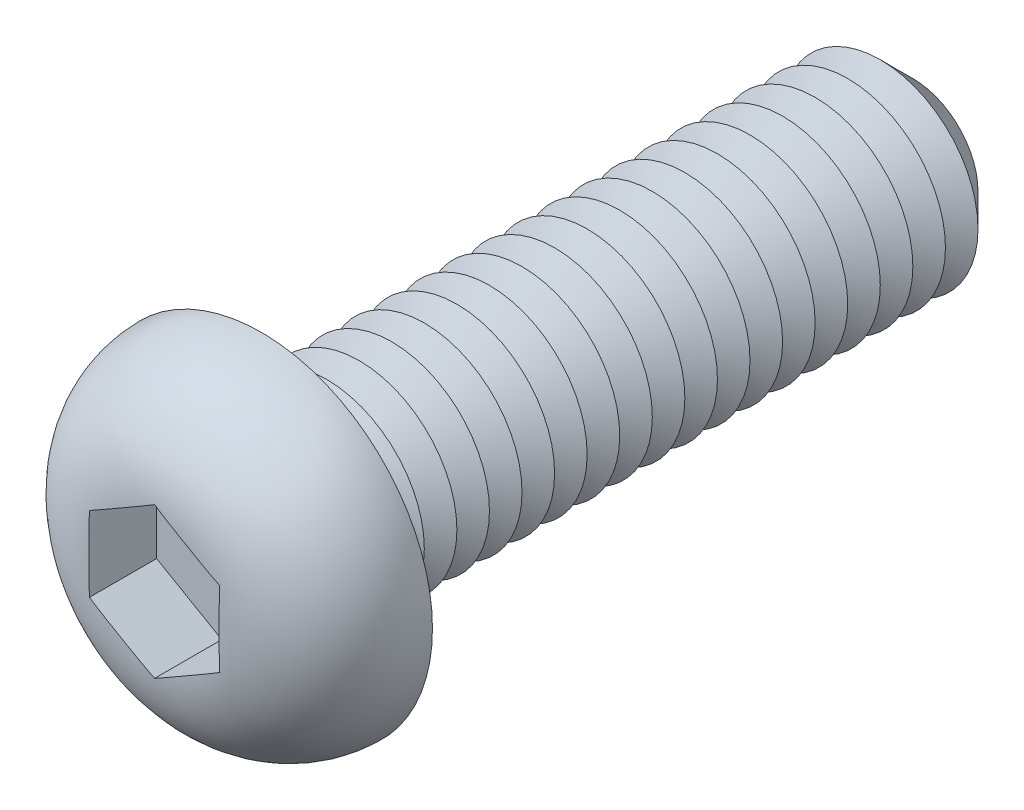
ISO-10303-21;
HEADER;
FILE_DESCRIPTION(('STEP AP214'),'2;1');
FILE_NAME('part.step','',(''),(''),'','','');
FILE_SCHEMA(('AUTOMOTIVE_DESIGN { 1 0 10303 214 1 1 1 1 }'));
ENDSEC;
DATA;
#1=APPLICATION_CONTEXT('core data for automotive mechanical design processes');
#2=APPLICATION_PROTOCOL_DEFINITION('international standard','automotive_design',2000,#1);
#3=PRODUCT_CONTEXT('',#1,'mechanical');
#4=PRODUCT('Part','Part','',(#3));
#5=PRODUCT_RELATED_PRODUCT_CATEGORY('part','',(#4));
#6=PRODUCT_DEFINITION_FORMATION('','',#4);
#7=PRODUCT_DEFINITION_CONTEXT('part definition',#1,'design');
#8=PRODUCT_DEFINITION('design','',#6,#7);
#9=PRODUCT_DEFINITION_SHAPE('','',#8);
#10=(LENGTH_UNIT() NAMED_UNIT(*) SI_UNIT(.MILLI.,.METRE.));
#11=(NAMED_UNIT(*) PLANE_ANGLE_UNIT() SI_UNIT($,.RADIAN.));
#12=(NAMED_UNIT(*) SI_UNIT($,.STERADIAN.) SOLID_ANGLE_UNIT());
#13=UNCERTAINTY_MEASURE_WITH_UNIT(LENGTH_MEASURE(1.E-05),#10,'distance_accuracy_value','');
#14=(GEOMETRIC_REPRESENTATION_CONTEXT(3) GLOBAL_UNCERTAINTY_ASSIGNED_CONTEXT((#13)) GLOBAL_UNIT_ASSIGNED_CONTEXT((#10,
#11,#12)) REPRESENTATION_CONTEXT('',''));
#15=CARTESIAN_POINT('',(0.,0.,0.));
#16=DIRECTION('',(0.,0.,1.));
#17=DIRECTION('',(1.,0.,0.));
#18=AXIS2_PLACEMENT_3D('',#15,#16,#17);
#19=CARTESIAN_POINT('',(0.,0.,-20.));
#20=DIRECTION('',(0.,0.,1.));
#21=DIRECTION('',(1.,0.,0.));
#22=AXIS2_PLACEMENT_3D('',#19,#20,#21);
#23=CYLINDRICAL_SURFACE('',#22,3.);
#24=CARTESIAN_POINT('',(0.,0.,-0.5));
#25=DIRECTION('',(0.,0.,1.));
#26=DIRECTION('',(1.,0.,0.));
#27=AXIS2_PLACEMENT_3D('',#24,#25,#26);
#28=CIRCLE('',#27,3.);
#29=CARTESIAN_POINT('',(3.,0.,-0.5));
#30=VERTEX_POINT('',#29);
#31=EDGE_CURVE('E48',#30,#30,#28,.F.);
#32=ORIENTED_EDGE('',*,*,#31,.T.);
#33=EDGE_LOOP('',(#32));
#34=FACE_BOUND('',#33,.T.);
#35=CARTESIAN_POINT('',(0.,0.,-1.));
#36=DIRECTION('',(0.,0.,1.));
#37=DIRECTION('',(1.,0.,0.));
#38=AXIS2_PLACEMENT_3D('',#35,#36,#37);
#39=CIRCLE('',#38,3.);
#40=CARTESIAN_POINT('',(3.,0.,-1.));
#41=VERTEX_POINT('',#40);
#42=EDGE_CURVE('E118',#41,#41,#39,.T.);
#43=ORIENTED_EDGE('',*,*,#42,.T.);
#44=EDGE_LOOP('',(#43));
#45=FACE_BOUND('',#44,.T.);
#46=ADVANCED_FACE('F39',(#34,#45),#23,.T.);
#47=CARTESIAN_POINT('',(0.,5.25,0.));
#48=DIRECTION('',(0.,0.,1.));
#49=DIRECTION('',(1.,0.,0.));
#50=AXIS2_PLACEMENT_3D('',#47,#48,#49);
#51=PLANE('',#50);
#52=CARTESIAN_POINT('',(0.,0.,0.));
#53=DIRECTION('',(0.,0.,1.));
#54=DIRECTION('',(1.,0.,0.));
#55=AXIS2_PLACEMENT_3D('',#52,#53,#54);
#56=CIRCLE('',#55,3.5);
#57=CARTESIAN_POINT('',(3.5,0.,0.));
#58=VERTEX_POINT('',#57);
#59=EDGE_CURVE('E11',#58,#58,#56,.T.);
#60=ORIENTED_EDGE('',*,*,#59,.T.);
#61=EDGE_LOOP('',(#60));
#62=FACE_BOUND('',#61,.T.);
#63=CARTESIAN_POINT('',(0.,0.,0.));
#64=DIRECTION('',(0.,0.,1.));
#65=DIRECTION('',(1.,0.,0.));
#66=AXIS2_PLACEMENT_3D('',#63,#64,#65);
#67=CIRCLE('',#66,5.25);
#68=CARTESIAN_POINT('',(5.25,0.,0.));
#69=VERTEX_POINT('',#68);
#70=EDGE_CURVE('E142',#69,#69,#67,.T.);
#71=ORIENTED_EDGE('',*,*,#70,.F.);
#72=EDGE_LOOP('',(#71));
#73=FACE_BOUND('',#72,.T.);
#74=ADVANCED_FACE('F218',(#62,#73),#51,.F.);
#75=CARTESIAN_POINT('',(0.,0.,0.));
#76=DIRECTION('',(0.,0.,1.));
#77=DIRECTION('',(1.,0.,0.));
#78=AXIS2_PLACEMENT_3D('',#75,#76,#77);
#79=DEGENERATE_TOROIDAL_SURFACE('',#78,1.95,3.3,.T.);
#80=CARTESIAN_POINT('',(-2.0002,1.15458506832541,3.28035788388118));
#81=CARTESIAN_POINT('',(-1.91691288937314,1.20267090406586,3.28561413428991));
#82=CARTESIAN_POINT('',(-1.83357497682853,1.25078607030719,3.2893341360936));
#83=CARTESIAN_POINT('',(-1.66686712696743,1.34703489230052,3.29467873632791));
#84=CARTESIAN_POINT('',(-1.58349720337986,1.39516854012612,3.29630387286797));
#85=CARTESIAN_POINT('',(-1.4167768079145,1.49142460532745,3.29843721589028));
#86=CARTESIAN_POINT('',(-1.33342633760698,1.53954702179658,3.29894575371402));
#87=CARTESIAN_POINT('',(-1.16671724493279,1.63579656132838,3.29953775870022));
#88=CARTESIAN_POINT('',(-1.0833586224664,1.68392368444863,3.29962119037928));
#89=CARTESIAN_POINT('',(-0.916641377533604,1.78017793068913,3.29962119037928));
#90=CARTESIAN_POINT('',(-0.833282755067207,1.82830505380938,3.29953775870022));
#91=CARTESIAN_POINT('',(-0.666573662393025,1.92455459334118,3.29894575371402));
#92=CARTESIAN_POINT('',(-0.5832231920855,1.97267700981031,3.29843721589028));
#93=CARTESIAN_POINT('',(-0.416502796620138,2.06893307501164,3.29630387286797));
#94=CARTESIAN_POINT('',(-0.333132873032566,2.11706672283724,3.29467873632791));
#95=CARTESIAN_POINT('',(-0.166425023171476,2.21331554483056,3.2893341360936));
#96=CARTESIAN_POINT('',(-0.083087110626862,2.2614307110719,3.28561413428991));
#97=CARTESIAN_POINT('',(0.000200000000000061,2.30951654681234,3.28035788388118));
#98=B_SPLINE_CURVE_WITH_KNOTS('',3,(#80,#81,#82,#83,#84,#85,#86,#87,#88,#89,#90,#91,#92,#93,#94,
#95,#96,#97),.UNSPECIFIED.,.F.,.F.,(4,2,2,2,2,2,2,2,4),(0.,0.288898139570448,0.577722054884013,
0.866460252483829,1.15522255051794,1.44398484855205,1.73272304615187,2.02154696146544,
2.31044510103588),.UNSPECIFIED.);
#99=CARTESIAN_POINT('',(-2.,1.15470053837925,3.28037053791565));
#100=VERTEX_POINT('',#99);
#101=CARTESIAN_POINT('',(0.,2.3094010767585,3.28037053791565));
#102=VERTEX_POINT('',#101);
#103=EDGE_CURVE('E159',#100,#102,#98,.T.);
#104=ORIENTED_EDGE('',*,*,#103,.T.);
#105=CARTESIAN_POINT('',(-0.000199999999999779,2.30951654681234,3.28035788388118));
#106=CARTESIAN_POINT('',(0.0830871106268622,2.2614307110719,3.28561413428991));
#107=CARTESIAN_POINT('',(0.166425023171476,2.21331554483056,3.2893341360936));
#108=CARTESIAN_POINT('',(0.333132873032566,2.11706672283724,3.29467873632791));
#109=CARTESIAN_POINT('',(0.416502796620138,2.06893307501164,3.29630387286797));
#110=CARTESIAN_POINT('',(0.5832231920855,1.97267700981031,3.29843721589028));
#111=CARTESIAN_POINT('',(0.666573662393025,1.92455459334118,3.29894575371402));
#112=CARTESIAN_POINT('',(0.833282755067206,1.82830505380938,3.29953775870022));
#113=CARTESIAN_POINT('',(0.916641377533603,1.78017793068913,3.29962119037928));
#114=CARTESIAN_POINT('',(1.0833586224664,1.68392368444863,3.29962119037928));
#115=CARTESIAN_POINT('',(1.16671724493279,1.63579656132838,3.29953775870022));
#116=CARTESIAN_POINT('',(1.33342633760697,1.53954702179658,3.29894575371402));
#117=CARTESIAN_POINT('',(1.4167768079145,1.49142460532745,3.29843721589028));
#118=CARTESIAN_POINT('',(1.58349720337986,1.39516854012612,3.29630387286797));
#119=CARTESIAN_POINT('',(1.66686712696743,1.34703489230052,3.29467873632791));
#120=CARTESIAN_POINT('',(1.83357497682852,1.25078607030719,3.2893341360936));
#121=CARTESIAN_POINT('',(1.91691288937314,1.20267090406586,3.28561413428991));
#122=CARTESIAN_POINT('',(2.0002,1.15458506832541,3.28035788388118));
#123=B_SPLINE_CURVE_WITH_KNOTS('',3,(#105,#106,#107,#108,#109,#110,#111,#112,#113,#114,#115,
#116,#117,#118,#119,#120,#121,#122),.UNSPECIFIED.,.F.,.F.,(4,2,2,2,2,2,2,2,4),(0.,
0.288898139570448,0.577722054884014,0.866460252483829,1.15522255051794,1.44398484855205,
1.73272304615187,2.02154696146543,2.31044510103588),.UNSPECIFIED.);
#124=CARTESIAN_POINT('',(2.,1.15470053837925,3.28037053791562));
#125=VERTEX_POINT('',#124);
#126=EDGE_CURVE('E98',#102,#125,#123,.T.);
#127=ORIENTED_EDGE('',*,*,#126,.T.);
#128=CARTESIAN_POINT('',(2.,0.,3.29962119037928));
#129=CARTESIAN_POINT('',(2.,-0.083776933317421,3.29962202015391));
#130=CARTESIAN_POINT('',(2.,-0.16755385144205,3.29955399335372));
#131=CARTESIAN_POINT('',(2.,-0.335108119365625,3.29913665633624));
#132=CARTESIAN_POINT('',(2.,-0.418885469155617,3.29878734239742));
#133=CARTESIAN_POINT('',(2.,-0.58647412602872,3.29739645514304));
#134=CARTESIAN_POINT('',(2.,-0.670285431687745,3.29635457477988));
#135=CARTESIAN_POINT('',(2.,-0.83788107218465,3.29299045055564));
#136=CARTESIAN_POINT('',(2.,-0.921665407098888,3.29066821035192));
#137=CARTESIAN_POINT('',(2.,-1.1722454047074,3.2807858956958));
#138=CARTESIAN_POINT('',(2.,-1.33895832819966,3.27031526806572));
#139=CARTESIAN_POINT('',(2.,-1.67103623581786,3.23635494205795));
#140=CARTESIAN_POINT('',(2.,-1.83640244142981,3.21287879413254));
#141=CARTESIAN_POINT('',(2.,-2.10344176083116,3.16074182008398));
#142=CARTESIAN_POINT('',(2.,-2.2061099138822,3.13718731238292));
#143=CARTESIAN_POINT('',(2.,-2.40948794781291,3.08263206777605));
#144=CARTESIAN_POINT('',(2.,-2.51019754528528,3.05163026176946));
#145=CARTESIAN_POINT('',(2.,-2.70894468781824,2.98167613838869));
#146=CARTESIAN_POINT('',(2.,-2.80697949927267,2.94271600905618));
#147=CARTESIAN_POINT('',(2.,-2.9994014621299,2.85662314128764));
#148=CARTESIAN_POINT('',(2.,-3.09378880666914,2.80949083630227));
#149=CARTESIAN_POINT('',(2.,-3.27874879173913,2.70660110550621));
#150=CARTESIAN_POINT('',(2.,-3.36928473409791,2.6507774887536));
#151=CARTESIAN_POINT('',(2.,-3.54476824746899,2.53095107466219));
#152=CARTESIAN_POINT('',(2.,-3.6297163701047,2.46694908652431));
#153=CARTESIAN_POINT('',(2.,-3.79309021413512,2.33110056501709));
#154=CARTESIAN_POINT('',(2.,-3.87151694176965,2.25925524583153));
#155=CARTESIAN_POINT('',(2.,-4.02093628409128,2.10826339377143));
#156=CARTESIAN_POINT('',(2.,-4.09192987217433,2.02911781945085));
#157=CARTESIAN_POINT('',(2.,-4.27732278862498,1.8003635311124));
#158=CARTESIAN_POINT('',(2.,-4.38297261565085,1.64348590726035));
#159=CARTESIAN_POINT('',(2.,-4.564185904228,1.31336862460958));
#160=CARTESIAN_POINT('',(2.,-4.63976443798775,1.14013721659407));
#161=CARTESIAN_POINT('',(2.,-4.75417820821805,0.794488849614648));
#162=CARTESIAN_POINT('',(2.,-4.79509243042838,0.622758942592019));
#163=CARTESIAN_POINT('',(2.,-4.84679751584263,0.274828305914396));
#164=CARTESIAN_POINT('',(2.,-4.85759267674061,0.098628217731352));
#165=CARTESIAN_POINT('',(2.,-4.8487955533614,-0.249157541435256));
#166=CARTESIAN_POINT('',(2.,-4.82985906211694,-0.420760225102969));
#167=CARTESIAN_POINT('',(2.,-4.76345103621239,-0.758322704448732));
#168=CARTESIAN_POINT('',(2.,-4.71598351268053,-0.924283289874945));
#169=CARTESIAN_POINT('',(2.,-4.59404942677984,-1.24604183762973));
#170=CARTESIAN_POINT('',(2.,-4.51956988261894,-1.40183487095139));
#171=CARTESIAN_POINT('',(2.,-4.34600859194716,-1.6990817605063));
#172=CARTESIAN_POINT('',(2.,-4.24691988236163,-1.84053154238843));
#173=CARTESIAN_POINT('',(2.,-4.02493220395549,-2.10847549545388));
#174=CARTESIAN_POINT('',(2.,-3.90156532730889,-2.23458080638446));
#175=CARTESIAN_POINT('',(2.,-3.63636218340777,-2.46550695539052));
#176=CARTESIAN_POINT('',(2.,-3.49453117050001,-2.57033382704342));
#177=CARTESIAN_POINT('',(2.,-3.26713798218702,-2.7130834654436));
#178=CARTESIAN_POINT('',(2.,-3.18660091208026,-2.75923686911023));
#179=CARTESIAN_POINT('',(2.,-3.02216370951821,-2.84520816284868));
#180=CARTESIAN_POINT('',(2.,-2.93826250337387,-2.88502400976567));
#181=CARTESIAN_POINT('',(2.,-2.76779132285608,-2.95832456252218));
#182=CARTESIAN_POINT('',(2.,-2.68122238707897,-2.99181169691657));
#183=CARTESIAN_POINT('',(2.,-2.50604626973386,-3.05263810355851));
#184=CARTESIAN_POINT('',(2.,-2.41744088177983,-3.07998257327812));
#185=CARTESIAN_POINT('',(2.,-2.20396420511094,-3.13835394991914));
#186=CARTESIAN_POINT('',(2.,-2.07835656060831,-3.16669536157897));
#187=CARTESIAN_POINT('',(2.,-1.82529007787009,-3.2134938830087));
#188=CARTESIAN_POINT('',(2.,-1.69783012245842,-3.23194474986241));
#189=CARTESIAN_POINT('',(2.,-1.44149598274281,-3.26083645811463));
#190=CARTESIAN_POINT('',(2.,-1.31261808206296,-3.27124272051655));
#191=CARTESIAN_POINT('',(2.,-1.05456848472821,-3.28623769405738));
#192=CARTESIAN_POINT('',(2.,-0.925396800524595,-3.29082664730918));
#193=CARTESIAN_POINT('',(2.,-0.665550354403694,-3.29674923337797));
#194=CARTESIAN_POINT('',(2.,-0.53487497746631,-3.29804579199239));
#195=CARTESIAN_POINT('',(2.,-0.273526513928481,-3.29947536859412));
#196=CARTESIAN_POINT('',(2.,-0.142853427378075,-3.29960842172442));
#197=CARTESIAN_POINT('',(2.,0.118243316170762,-3.29963281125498));
#198=CARTESIAN_POINT('',(2.,0.248666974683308,-3.29952460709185));
#199=CARTESIAN_POINT('',(2.,0.509509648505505,-3.29825409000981));
#200=CARTESIAN_POINT('',(2.,0.639928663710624,-3.29709183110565));
#201=CARTESIAN_POINT('',(2.,0.831730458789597,-3.29304171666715));
#202=CARTESIAN_POINT('',(2.,0.89313616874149,-3.29139197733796));
#203=CARTESIAN_POINT('',(2.,1.01591282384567,-3.28711504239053));
#204=CARTESIAN_POINT('',(2.,1.07728376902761,-3.28448784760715));
#205=CARTESIAN_POINT('',(2.,1.26131335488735,-3.27473407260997));
#206=CARTESIAN_POINT('',(2.,1.38388698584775,-3.2657353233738));
#207=CARTESIAN_POINT('',(2.,1.62750125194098,-3.24079239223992));
#208=CARTESIAN_POINT('',(2.,1.74854662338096,-3.22489680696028));
#209=CARTESIAN_POINT('',(2.,1.98924449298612,-3.18452451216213));
#210=CARTESIAN_POINT('',(2.,2.10889688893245,-3.16004717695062));
#211=CARTESIAN_POINT('',(2.,2.34827145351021,-3.10067973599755));
#212=CARTESIAN_POINT('',(2.,2.46794336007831,-3.06558373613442));
#213=CARTESIAN_POINT('',(2.,2.70350765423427,-2.98433995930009));
#214=CARTESIAN_POINT('',(2.,2.8194000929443,-2.9381923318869));
#215=CARTESIAN_POINT('',(2.,3.0462872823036,-2.83430045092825));
#216=CARTESIAN_POINT('',(2.,3.157267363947,-2.77652399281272));
#217=CARTESIAN_POINT('',(2.,3.37244069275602,-2.64945989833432));
#218=CARTESIAN_POINT('',(2.,3.47663511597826,-2.58017426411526));
#219=CARTESIAN_POINT('',(2.,3.66184410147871,-2.44158969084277));
#220=CARTESIAN_POINT('',(2.,3.74400419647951,-2.37381785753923));
#221=CARTESIAN_POINT('',(2.,3.90136233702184,-2.23063102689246));
#222=CARTESIAN_POINT('',(2.,3.9765614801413,-2.1552172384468));
#223=CARTESIAN_POINT('',(2.,4.11902811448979,-1.99742327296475));
#224=CARTESIAN_POINT('',(2.,4.18630715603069,-1.91505354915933));
#225=CARTESIAN_POINT('',(2.,4.31224227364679,-1.74401295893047));
#226=CARTESIAN_POINT('',(2.,4.37089943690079,-1.65534288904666));
#227=CARTESIAN_POINT('',(2.,4.51742320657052,-1.40720395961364));
#228=CARTESIAN_POINT('',(2.,4.59632371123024,-1.24230503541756));
#229=CARTESIAN_POINT('',(2.,4.72377654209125,-0.901269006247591));
#230=CARTESIAN_POINT('',(2.,4.77233626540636,-0.725134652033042));
#231=CARTESIAN_POINT('',(2.,4.83594291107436,-0.375162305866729));
#232=CARTESIAN_POINT('',(2.,4.85240855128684,-0.201581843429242));
#233=CARTESIAN_POINT('',(2.,4.85558073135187,0.145835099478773));
#234=CARTESIAN_POINT('',(2.,4.8422910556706,0.319671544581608));
#235=CARTESIAN_POINT('',(2.,4.78674180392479,0.660539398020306));
#236=CARTESIAN_POINT('',(2.,4.74482430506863,0.827626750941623));
#237=CARTESIAN_POINT('',(2.,4.63375789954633,1.15246461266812));
#238=CARTESIAN_POINT('',(2.,4.56461058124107,1.31021566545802));
#239=CARTESIAN_POINT('',(2.,4.40063624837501,1.61344814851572));
#240=CARTESIAN_POINT('',(2.,4.30559842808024,1.75881539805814));
#241=CARTESIAN_POINT('',(2.,4.09315528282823,2.03216183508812));
#242=CARTESIAN_POINT('',(2.,3.97574503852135,2.16013718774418));
#243=CARTESIAN_POINT('',(2.,3.71810418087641,2.3997527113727));
#244=CARTESIAN_POINT('',(2.,3.57725563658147,2.51072635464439));
#245=CARTESIAN_POINT('',(2.,3.28005668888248,2.70933274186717));
#246=CARTESIAN_POINT('',(2.,3.12370896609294,2.79696951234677));
#247=CARTESIAN_POINT('',(2.,2.85462284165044,2.92305372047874));
#248=CARTESIAN_POINT('',(2.,2.74490899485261,2.96813077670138));
#249=CARTESIAN_POINT('',(2.,2.52184151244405,3.04824715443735));
#250=CARTESIAN_POINT('',(2.,2.40848685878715,3.08328364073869));
#251=CARTESIAN_POINT('',(2.,2.17918323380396,3.14397693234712));
#252=CARTESIAN_POINT('',(2.,2.06323128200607,3.16962230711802));
#253=CARTESIAN_POINT('',(2.,1.82982653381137,3.21251895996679));
#254=CARTESIAN_POINT('',(2.,1.71237385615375,3.229770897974));
#255=CARTESIAN_POINT('',(2.,1.46252543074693,3.2589582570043));
#256=CARTESIAN_POINT('',(2.,1.3300298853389,3.27000580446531));
#257=CARTESIAN_POINT('',(2.,1.0646774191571,3.28585371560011));
#258=CARTESIAN_POINT('',(2.,0.931820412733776,3.29065244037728));
#259=CARTESIAN_POINT('',(2.,0.665789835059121,3.29677132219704));
#260=CARTESIAN_POINT('',(2.,0.532616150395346,3.29808470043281));
#261=CARTESIAN_POINT('',(2.,0.332868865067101,3.29913679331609));
#262=CARTESIAN_POINT('',(2.,0.266295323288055,3.2993345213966));
#263=CARTESIAN_POINT('',(2.,0.133147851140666,3.29957639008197));
#264=CARTESIAN_POINT('',(2.,0.0665739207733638,3.29962053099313));
#265=CARTESIAN_POINT('',(2.,0.,3.29962119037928));
#266=B_SPLINE_CURVE_WITH_KNOTS('',3,(#128,#129,#130,#131,#132,#133,#134,#135,#136,#137,#138,
#139,#140,#141,#142,#143,#144,#145,#146,#147,#148,#149,#150,#151,#152,#153,#154,#155,#156,#157,
#158,#159,#160,#161,#162,#163,#164,#165,#166,#167,#168,#169,#170,#171,#172,#173,#174,#175,#176,
#177,#178,#179,#180,#181,#182,#183,#184,#185,#186,#187,#188,#189,#190,#191,#192,#193,#194,#195,
#196,#197,#198,#199,#200,#201,#202,#203,#204,#205,#206,#207,#208,#209,#210,#211,#212,#213,#214,
#215,#216,#217,#218,#219,#220,#221,#222,#223,#224,#225,#226,#227,#228,#229,#230,#231,#232,#233,
#234,#235,#236,#237,#238,#239,#240,#241,#242,#243,#244,#245,#246,#247,#248,#249,#250,#251,#252,
#253,#254,#255,#256,#257,#258,#259,#260,#261,#262,#263,#264,#265),.UNSPECIFIED.,.T.,.F.,(4,2,2,
2,2,2,2,2,2,2,2,2,2,2,2,2,2,2,2,2,2,2,2,2,2,2,2,2,2,2,2,2,2,2,2,2,2,2,2,2,2,2,2,2,2,2,2,2,2,2,2,
2,2,2,2,2,2,2,2,2,2,2,2,2,2,2,2,2,4),(0.,0.251330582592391,0.502664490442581,0.754109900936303,
1.00555459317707,1.50637447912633,2.00667353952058,2.32243701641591,2.63824585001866,
2.95436618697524,3.27046976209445,3.58911045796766,3.90771965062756,4.22627959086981,
4.5447977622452,5.10896009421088,5.67283930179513,6.19985685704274,6.72679920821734,
7.24228104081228,7.75769041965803,8.27334782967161,8.78915130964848,9.3160918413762,
9.84288274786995,10.1211212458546,10.3994492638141,10.6776702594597,10.9556549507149,
11.3414617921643,11.727511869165,12.1152122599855,12.5028965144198,12.8949273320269,
13.2869463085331,13.6782193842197,14.0694724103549,14.2537488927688,14.4380252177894,
14.8065831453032,15.1725852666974,15.5386140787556,15.9122523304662,16.28588552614,
16.6605680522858,17.0351854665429,17.3542226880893,17.6732095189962,17.9917252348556,
18.3102007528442,18.8555909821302,19.4008481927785,19.9214008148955,20.4418872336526,
20.9562606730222,21.4706041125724,21.9892675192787,22.5080451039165,23.0436926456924,
23.5792477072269,23.9346277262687,24.2901079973,24.6460195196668,25.0019030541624,
25.4005476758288,25.7992968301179,26.1988209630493,26.3985429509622,26.5982645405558),.UNSPECIFIED.);
#267=CARTESIAN_POINT('',(2.,-1.15470053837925,3.28037053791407));
#268=VERTEX_POINT('',#267);
#269=EDGE_CURVE('E63',#125,#268,#266,.T.);
#270=ORIENTED_EDGE('',*,*,#269,.T.);
#271=CARTESIAN_POINT('',(2.0002,-1.15458506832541,3.28035788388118));
#272=CARTESIAN_POINT('',(1.91691288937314,-1.20267090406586,3.28561413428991));
#273=CARTESIAN_POINT('',(1.83357497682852,-1.25078607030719,3.2893341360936));
#274=CARTESIAN_POINT('',(1.66686712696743,-1.34703489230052,3.29467873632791));
#275=CARTESIAN_POINT('',(1.58349720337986,-1.39516854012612,3.29630387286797));
#276=CARTESIAN_POINT('',(1.4167768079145,-1.49142460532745,3.29843721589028));
#277=CARTESIAN_POINT('',(1.33342633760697,-1.53954702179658,3.29894575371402));
#278=CARTESIAN_POINT('',(1.16671724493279,-1.63579656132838,3.29953775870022));
#279=CARTESIAN_POINT('',(1.0833586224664,-1.68392368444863,3.29962119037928));
#280=CARTESIAN_POINT('',(0.916641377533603,-1.78017793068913,3.29962119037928));
#281=CARTESIAN_POINT('',(0.833282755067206,-1.82830505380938,3.29953775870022));
#282=CARTESIAN_POINT('',(0.666573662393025,-1.92455459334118,3.29894575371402));
#283=CARTESIAN_POINT('',(0.5832231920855,-1.97267700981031,3.29843721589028));
#284=CARTESIAN_POINT('',(0.416502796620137,-2.06893307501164,3.29630387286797));
#285=CARTESIAN_POINT('',(0.333132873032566,-2.11706672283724,3.29467873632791));
#286=CARTESIAN_POINT('',(0.166425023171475,-2.21331554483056,3.2893341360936));
#287=CARTESIAN_POINT('',(0.0830871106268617,-2.2614307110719,3.28561413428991));
#288=CARTESIAN_POINT('',(-0.000200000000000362,-2.30951654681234,3.28035788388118));
#289=B_SPLINE_CURVE_WITH_KNOTS('',3,(#271,#272,#273,#274,#275,#276,#277,#278,#279,#280,#281,
#282,#283,#284,#285,#286,#287,#288),.UNSPECIFIED.,.F.,.F.,(4,2,2,2,2,2,2,2,4),(0.,
0.288898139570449,0.577722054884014,0.86646025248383,1.15522255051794,1.44398484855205,
1.73272304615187,2.02154696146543,2.31044510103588),.UNSPECIFIED.);
#290=CARTESIAN_POINT('',(0.,-2.3094010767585,3.28037053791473));
#291=VERTEX_POINT('',#290);
#292=EDGE_CURVE('E239',#268,#291,#289,.T.);
#293=ORIENTED_EDGE('',*,*,#292,.T.);
#294=CARTESIAN_POINT('',(0.000199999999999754,-2.30951654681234,3.28035788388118));
#295=CARTESIAN_POINT('',(-0.0830871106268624,-2.2614307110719,3.28561413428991));
#296=CARTESIAN_POINT('',(-0.166425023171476,-2.21331554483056,3.2893341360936));
#297=CARTESIAN_POINT('',(-0.333132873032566,-2.11706672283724,3.29467873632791));
#298=CARTESIAN_POINT('',(-0.416502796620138,-2.06893307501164,3.29630387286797));
#299=CARTESIAN_POINT('',(-0.5832231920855,-1.97267700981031,3.29843721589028));
#300=CARTESIAN_POINT('',(-0.666573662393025,-1.92455459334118,3.29894575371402));
#301=CARTESIAN_POINT('',(-0.833282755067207,-1.82830505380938,3.29953775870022));
#302=CARTESIAN_POINT('',(-0.916641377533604,-1.78017793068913,3.29962119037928));
#303=CARTESIAN_POINT('',(-1.0833586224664,-1.68392368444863,3.29962119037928));
#304=CARTESIAN_POINT('',(-1.16671724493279,-1.63579656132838,3.29953775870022));
#305=CARTESIAN_POINT('',(-1.33342633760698,-1.53954702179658,3.29894575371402));
#306=CARTESIAN_POINT('',(-1.4167768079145,-1.49142460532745,3.29843721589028));
#307=CARTESIAN_POINT('',(-1.58349720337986,-1.39516854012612,3.29630387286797));
#308=CARTESIAN_POINT('',(-1.66686712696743,-1.34703489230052,3.29467873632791));
#309=CARTESIAN_POINT('',(-1.83357497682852,-1.25078607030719,3.2893341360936));
#310=CARTESIAN_POINT('',(-1.91691288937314,-1.20267090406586,3.28561413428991));
#311=CARTESIAN_POINT('',(-2.0002,-1.15458506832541,3.28035788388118));
#312=B_SPLINE_CURVE_WITH_KNOTS('',3,(#294,#295,#296,#297,#298,#299,#300,#301,#302,#303,#304,
#305,#306,#307,#308,#309,#310,#311),.UNSPECIFIED.,.F.,.F.,(4,2,2,2,2,2,2,2,4),(0.,
0.288898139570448,0.577722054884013,0.866460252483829,1.15522255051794,1.44398484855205,
1.73272304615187,2.02154696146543,2.31044510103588),.UNSPECIFIED.);
#313=CARTESIAN_POINT('',(-2.,-1.15470053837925,3.28037053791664));
#314=VERTEX_POINT('',#313);
#315=EDGE_CURVE('E245',#291,#314,#312,.T.);
#316=ORIENTED_EDGE('',*,*,#315,.T.);
#317=CARTESIAN_POINT('',(-2.,0.,3.29962119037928));
#318=CARTESIAN_POINT('',(-2.,0.083776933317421,3.29962202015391));
#319=CARTESIAN_POINT('',(-2.,0.16755385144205,3.29955399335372));
#320=CARTESIAN_POINT('',(-2.,0.335108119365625,3.29913665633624));
#321=CARTESIAN_POINT('',(-2.,0.418885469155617,3.29878734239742));
#322=CARTESIAN_POINT('',(-2.,0.58647412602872,3.29739645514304));
#323=CARTESIAN_POINT('',(-2.,0.670285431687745,3.29635457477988));
#324=CARTESIAN_POINT('',(-2.,0.83788107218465,3.29299045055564));
#325=CARTESIAN_POINT('',(-2.,0.921665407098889,3.29066821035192));
#326=CARTESIAN_POINT('',(-2.,1.1722454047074,3.2807858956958));
#327=CARTESIAN_POINT('',(-2.,1.33895832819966,3.27031526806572));
#328=CARTESIAN_POINT('',(-2.,1.67103623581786,3.23635494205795));
#329=CARTESIAN_POINT('',(-2.,1.83640244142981,3.21287879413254));
#330=CARTESIAN_POINT('',(-2.,2.10344176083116,3.16074182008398));
#331=CARTESIAN_POINT('',(-2.,2.2061099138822,3.13718731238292));
#332=CARTESIAN_POINT('',(-2.,2.40948794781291,3.08263206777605));
#333=CARTESIAN_POINT('',(-2.,2.51019754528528,3.05163026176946));
#334=CARTESIAN_POINT('',(-2.,2.70894468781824,2.98167613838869));
#335=CARTESIAN_POINT('',(-2.,2.80697949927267,2.94271600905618));
#336=CARTESIAN_POINT('',(-2.,2.9994014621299,2.85662314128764));
#337=CARTESIAN_POINT('',(-2.,3.09378880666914,2.80949083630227));
#338=CARTESIAN_POINT('',(-2.,3.27874879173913,2.70660110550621));
#339=CARTESIAN_POINT('',(-2.,3.36928473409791,2.6507774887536));
#340=CARTESIAN_POINT('',(-2.,3.54476824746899,2.53095107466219));
#341=CARTESIAN_POINT('',(-2.,3.6297163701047,2.46694908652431));
#342=CARTESIAN_POINT('',(-2.,3.79309021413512,2.33110056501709));
#343=CARTESIAN_POINT('',(-2.,3.87151694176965,2.25925524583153));
#344=CARTESIAN_POINT('',(-2.,4.02093628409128,2.10826339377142));
#345=CARTESIAN_POINT('',(-2.,4.09192987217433,2.02911781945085));
#346=CARTESIAN_POINT('',(-2.,4.27732278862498,1.8003635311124));
#347=CARTESIAN_POINT('',(-2.,4.38297261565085,1.64348590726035));
#348=CARTESIAN_POINT('',(-2.,4.564185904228,1.31336862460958));
#349=CARTESIAN_POINT('',(-2.,4.63976443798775,1.14013721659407));
#350=CARTESIAN_POINT('',(-2.,4.75417820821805,0.794488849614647));
#351=CARTESIAN_POINT('',(-2.,4.79509243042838,0.622758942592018));
#352=CARTESIAN_POINT('',(-2.,4.84679751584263,0.274828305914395));
#353=CARTESIAN_POINT('',(-2.,4.85759267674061,0.0986282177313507));
#354=CARTESIAN_POINT('',(-2.,4.8487955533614,-0.249157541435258));
#355=CARTESIAN_POINT('',(-2.,4.82985906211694,-0.42076022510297));
#356=CARTESIAN_POINT('',(-2.,4.76345103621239,-0.758322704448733));
#357=CARTESIAN_POINT('',(-2.,4.71598351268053,-0.924283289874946));
#358=CARTESIAN_POINT('',(-2.,4.59404942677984,-1.24604183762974));
#359=CARTESIAN_POINT('',(-2.,4.51956988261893,-1.40183487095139));
#360=CARTESIAN_POINT('',(-2.,4.34600859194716,-1.6990817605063));
#361=CARTESIAN_POINT('',(-2.,4.24691988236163,-1.84053154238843));
#362=CARTESIAN_POINT('',(-2.,4.02493220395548,-2.10847549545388));
#363=CARTESIAN_POINT('',(-2.,3.90156532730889,-2.23458080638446));
#364=CARTESIAN_POINT('',(-2.,3.63636218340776,-2.46550695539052));
#365=CARTESIAN_POINT('',(-2.,3.49453117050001,-2.57033382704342));
#366=CARTESIAN_POINT('',(-2.,3.26713798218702,-2.7130834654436));
#367=CARTESIAN_POINT('',(-2.,3.18660091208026,-2.75923686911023));
#368=CARTESIAN_POINT('',(-2.,3.02216370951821,-2.84520816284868));
#369=CARTESIAN_POINT('',(-2.,2.93826250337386,-2.88502400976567));
#370=CARTESIAN_POINT('',(-2.,2.76779132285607,-2.95832456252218));
#371=CARTESIAN_POINT('',(-2.,2.68122238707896,-2.99181169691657));
#372=CARTESIAN_POINT('',(-2.,2.50604626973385,-3.05263810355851));
#373=CARTESIAN_POINT('',(-2.,2.41744088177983,-3.07998257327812));
#374=CARTESIAN_POINT('',(-2.,2.20396420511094,-3.13835394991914));
#375=CARTESIAN_POINT('',(-2.,2.0783565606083,-3.16669536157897));
#376=CARTESIAN_POINT('',(-2.,1.82529007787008,-3.2134938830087));
#377=CARTESIAN_POINT('',(-2.,1.69783012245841,-3.23194474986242));
#378=CARTESIAN_POINT('',(-2.,1.4414959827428,-3.26083645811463));
#379=CARTESIAN_POINT('',(-2.,1.31261808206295,-3.27124272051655));
#380=CARTESIAN_POINT('',(-2.,1.0545684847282,-3.28623769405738));
#381=CARTESIAN_POINT('',(-2.,0.925396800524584,-3.29082664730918));
#382=CARTESIAN_POINT('',(-2.,0.665550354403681,-3.29674923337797));
#383=CARTESIAN_POINT('',(-2.,0.534874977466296,-3.29804579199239));
#384=CARTESIAN_POINT('',(-2.,0.273526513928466,-3.29947536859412));
#385=CARTESIAN_POINT('',(-2.,0.142853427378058,-3.29960842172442));
#386=CARTESIAN_POINT('',(-2.,-0.11824331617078,-3.29963281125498));
#387=CARTESIAN_POINT('',(-2.,-0.248666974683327,-3.29952460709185));
#388=CARTESIAN_POINT('',(-2.,-0.509509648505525,-3.29825409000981));
#389=CARTESIAN_POINT('',(-2.,-0.639928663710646,-3.29709183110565));
#390=CARTESIAN_POINT('',(-2.,-0.83173045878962,-3.29304171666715));
#391=CARTESIAN_POINT('',(-2.,-0.893136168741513,-3.29139197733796));
#392=CARTESIAN_POINT('',(-2.,-1.0159128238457,-3.28711504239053));
#393=CARTESIAN_POINT('',(-2.,-1.07728376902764,-3.28448784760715));
#394=CARTESIAN_POINT('',(-2.,-1.26131335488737,-3.27473407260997));
#395=CARTESIAN_POINT('',(-2.,-1.38388698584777,-3.2657353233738));
#396=CARTESIAN_POINT('',(-2.,-1.627501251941,-3.24079239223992));
#397=CARTESIAN_POINT('',(-2.,-1.74854662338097,-3.22489680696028));
#398=CARTESIAN_POINT('',(-2.,-1.98924449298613,-3.18452451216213));
#399=CARTESIAN_POINT('',(-2.,-2.10889688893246,-3.16004717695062));
#400=CARTESIAN_POINT('',(-2.,-2.34827145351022,-3.10067973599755));
#401=CARTESIAN_POINT('',(-2.,-2.46794336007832,-3.06558373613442));
#402=CARTESIAN_POINT('',(-2.,-2.70350765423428,-2.98433995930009));
#403=CARTESIAN_POINT('',(-2.,-2.81940009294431,-2.93819233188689));
#404=CARTESIAN_POINT('',(-2.,-3.0462872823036,-2.83430045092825));
#405=CARTESIAN_POINT('',(-2.,-3.157267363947,-2.77652399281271));
#406=CARTESIAN_POINT('',(-2.,-3.37244069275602,-2.64945989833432));
#407=CARTESIAN_POINT('',(-2.,-3.47663511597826,-2.58017426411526));
#408=CARTESIAN_POINT('',(-2.,-3.66184410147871,-2.44158969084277));
#409=CARTESIAN_POINT('',(-2.,-3.74400419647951,-2.37381785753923));
#410=CARTESIAN_POINT('',(-2.,-3.90136233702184,-2.23063102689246));
#411=CARTESIAN_POINT('',(-2.,-3.9765614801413,-2.1552172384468));
#412=CARTESIAN_POINT('',(-2.,-4.11902811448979,-1.99742327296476));
#413=CARTESIAN_POINT('',(-2.,-4.18630715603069,-1.91505354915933));
#414=CARTESIAN_POINT('',(-2.,-4.31224227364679,-1.74401295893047));
#415=CARTESIAN_POINT('',(-2.,-4.37089943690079,-1.65534288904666));
#416=CARTESIAN_POINT('',(-2.,-4.51742320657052,-1.40720395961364));
#417=CARTESIAN_POINT('',(-2.,-4.59632371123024,-1.24230503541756));
#418=CARTESIAN_POINT('',(-2.,-4.72377654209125,-0.901269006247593));
#419=CARTESIAN_POINT('',(-2.,-4.77233626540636,-0.725134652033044));
#420=CARTESIAN_POINT('',(-2.,-4.83594291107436,-0.37516230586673));
#421=CARTESIAN_POINT('',(-2.,-4.85240855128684,-0.201581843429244));
#422=CARTESIAN_POINT('',(-2.,-4.85558073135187,0.145835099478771));
#423=CARTESIAN_POINT('',(-2.,-4.8422910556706,0.319671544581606));
#424=CARTESIAN_POINT('',(-2.,-4.78674180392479,0.660539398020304));
#425=CARTESIAN_POINT('',(-2.,-4.74482430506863,0.827626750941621));
#426=CARTESIAN_POINT('',(-2.,-4.63375789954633,1.15246461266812));
#427=CARTESIAN_POINT('',(-2.,-4.56461058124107,1.31021566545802));
#428=CARTESIAN_POINT('',(-2.,-4.40063624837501,1.61344814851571));
#429=CARTESIAN_POINT('',(-2.,-4.30559842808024,1.75881539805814));
#430=CARTESIAN_POINT('',(-2.,-4.09315528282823,2.03216183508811));
#431=CARTESIAN_POINT('',(-2.,-3.97574503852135,2.16013718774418));
#432=CARTESIAN_POINT('',(-2.,-3.71810418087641,2.39975271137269));
#433=CARTESIAN_POINT('',(-2.,-3.57725563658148,2.51072635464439));
#434=CARTESIAN_POINT('',(-2.,-3.28005668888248,2.70933274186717));
#435=CARTESIAN_POINT('',(-2.,-3.12370896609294,2.79696951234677));
#436=CARTESIAN_POINT('',(-2.,-2.85462284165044,2.92305372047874));
#437=CARTESIAN_POINT('',(-2.,-2.74490899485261,2.96813077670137));
#438=CARTESIAN_POINT('',(-2.,-2.52184151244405,3.04824715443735));
#439=CARTESIAN_POINT('',(-2.,-2.40848685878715,3.08328364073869));
#440=CARTESIAN_POINT('',(-2.,-2.17918323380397,3.14397693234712));
#441=CARTESIAN_POINT('',(-2.,-2.06323128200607,3.16962230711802));
#442=CARTESIAN_POINT('',(-2.,-1.82982653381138,3.21251895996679));
#443=CARTESIAN_POINT('',(-2.,-1.71237385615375,3.229770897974));
#444=CARTESIAN_POINT('',(-2.,-1.46252543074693,3.2589582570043));
#445=CARTESIAN_POINT('',(-2.,-1.33002988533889,3.27000580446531));
#446=CARTESIAN_POINT('',(-2.,-1.0646774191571,3.28585371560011));
#447=CARTESIAN_POINT('',(-2.,-0.931820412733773,3.29065244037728));
#448=CARTESIAN_POINT('',(-2.,-0.66578983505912,3.29677132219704));
#449=CARTESIAN_POINT('',(-2.,-0.532616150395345,3.29808470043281));
#450=CARTESIAN_POINT('',(-2.,-0.332868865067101,3.29913679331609));
#451=CARTESIAN_POINT('',(-2.,-0.266295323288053,3.2993345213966));
#452=CARTESIAN_POINT('',(-2.,-0.133147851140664,3.29957639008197));
#453=CARTESIAN_POINT('',(-2.,-0.0665739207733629,3.29962053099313));
#454=CARTESIAN_POINT('',(-2.,0.,3.29962119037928));
#455=B_SPLINE_CURVE_WITH_KNOTS('',3,(#317,#318,#319,#320,#321,#322,#323,#324,#325,#326,#327,
#328,#329,#330,#331,#332,#333,#334,#335,#336,#337,#338,#339,#340,#341,#342,#343,#344,#345,#346,
#347,#348,#349,#350,#351,#352,#353,#354,#355,#356,#357,#358,#359,#360,#361,#362,#363,#364,#365,
#366,#367,#368,#369,#370,#371,#372,#373,#374,#375,#376,#377,#378,#379,#380,#381,#382,#383,#384,
#385,#386,#387,#388,#389,#390,#391,#392,#393,#394,#395,#396,#397,#398,#399,#400,#401,#402,#403,
#404,#405,#406,#407,#408,#409,#410,#411,#412,#413,#414,#415,#416,#417,#418,#419,#420,#421,#422,
#423,#424,#425,#426,#427,#428,#429,#430,#431,#432,#433,#434,#435,#436,#437,#438,#439,#440,#441,
#442,#443,#444,#445,#446,#447,#448,#449,#450,#451,#452,#453,#454),.UNSPECIFIED.,.T.,.F.,(4,2,2,
2,2,2,2,2,2,2,2,2,2,2,2,2,2,2,2,2,2,2,2,2,2,2,2,2,2,2,2,2,2,2,2,2,2,2,2,2,2,2,2,2,2,2,2,2,2,2,2,
2,2,2,2,2,2,2,2,2,2,2,2,2,2,2,2,2,4),(0.,0.251330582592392,0.502664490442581,0.754109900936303,
1.00555459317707,1.50637447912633,2.00667353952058,2.32243701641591,2.63824585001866,
2.95436618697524,3.27046976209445,3.58911045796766,3.90771965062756,4.22627959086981,
4.5447977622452,5.10896009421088,5.67283930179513,6.19985685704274,6.72679920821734,
7.24228104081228,7.75769041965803,8.27334782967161,8.78915130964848,9.3160918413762,
9.84288274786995,10.1211212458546,10.3994492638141,10.6776702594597,10.9556549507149,
11.3414617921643,11.727511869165,12.1152122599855,12.5028965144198,12.8949273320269,
13.2869463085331,13.6782193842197,14.0694724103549,14.2537488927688,14.4380252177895,
14.8065831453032,15.1725852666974,15.5386140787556,15.9122523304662,16.28588552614,
16.6605680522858,17.0351854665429,17.3542226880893,17.6732095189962,17.9917252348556,
18.3102007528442,18.8555909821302,19.4008481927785,19.9214008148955,20.4418872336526,
20.9562606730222,21.4706041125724,21.9892675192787,22.5080451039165,23.0436926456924,
23.5792477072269,23.9346277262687,24.2901079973,24.6460195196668,25.0019030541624,
25.4005476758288,25.7992968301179,26.1988209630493,26.3985429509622,26.5982645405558),.UNSPECIFIED.);
#456=EDGE_CURVE('E167',#314,#100,#455,.T.);
#457=ORIENTED_EDGE('',*,*,#456,.T.);
#458=EDGE_LOOP('',(#104,#127,#270,#293,#316,#457));
#459=FACE_BOUND('',#458,.T.);
#460=ORIENTED_EDGE('',*,*,#70,.T.);
#461=EDGE_LOOP('',(#460));
#462=FACE_BOUND('',#461,.T.);
#463=ADVANCED_FACE('F172',(#459,#462),#79,.T.);
#464=CARTESIAN_POINT('',(2.,1.15470053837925,1.22));
#465=DIRECTION('',(0.5,0.866025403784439,0.));
#466=DIRECTION('',(-0.866025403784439,0.5,0.));
#467=AXIS2_PLACEMENT_3D('',#464,#465,#466);
#468=PLANE('',#467);
#469=DIRECTION('',(0.,0.,1.));
#470=VECTOR('',#469,1.);
#471=CARTESIAN_POINT('',(0.,2.3094010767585,1.22));
#472=LINE('',#471,#470);
#473=CARTESIAN_POINT('',(0.,2.3094010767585,1.22));
#474=VERTEX_POINT('',#473);
#475=EDGE_CURVE('E55',#474,#102,#472,.T.);
#476=ORIENTED_EDGE('',*,*,#475,.F.);
#477=DIRECTION('',(-0.866025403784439,0.5,0.));
#478=VECTOR('',#477,1.);
#479=CARTESIAN_POINT('',(2.,1.15470053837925,1.22));
#480=LINE('',#479,#478);
#481=CARTESIAN_POINT('',(2.,1.15470053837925,1.22));
#482=VERTEX_POINT('',#481);
#483=EDGE_CURVE('E95',#482,#474,#480,.T.);
#484=ORIENTED_EDGE('',*,*,#483,.F.);
#485=DIRECTION('',(0.,0.,1.));
#486=VECTOR('',#485,1.);
#487=CARTESIAN_POINT('',(2.,1.15470053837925,1.22));
#488=LINE('',#487,#486);
#489=EDGE_CURVE('E139',#482,#125,#488,.T.);
#490=ORIENTED_EDGE('',*,*,#489,.T.);
#491=ORIENTED_EDGE('',*,*,#126,.F.);
#492=EDGE_LOOP('',(#476,#484,#490,#491));
#493=FACE_BOUND('',#492,.T.);
#494=ADVANCED_FACE('F93',(#493),#468,.F.);
#495=CARTESIAN_POINT('',(2.,-1.15470053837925,1.22));
#496=DIRECTION('',(1.,0.,0.));
#497=DIRECTION('',(0.,1.,0.));
#498=AXIS2_PLACEMENT_3D('',#495,#496,#497);
#499=PLANE('',#498);
#500=ORIENTED_EDGE('',*,*,#489,.F.);
#501=DIRECTION('',(0.,1.,0.));
#502=VECTOR('',#501,1.);
#503=CARTESIAN_POINT('',(2.,-1.15470053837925,1.22));
#504=LINE('',#503,#502);
#505=CARTESIAN_POINT('',(2.,-1.15470053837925,1.22));
#506=VERTEX_POINT('',#505);
#507=EDGE_CURVE('E102',#506,#482,#504,.T.);
#508=ORIENTED_EDGE('',*,*,#507,.F.);
#509=DIRECTION('',(0.,0.,1.));
#510=VECTOR('',#509,1.);
#511=CARTESIAN_POINT('',(2.,-1.15470053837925,1.22));
#512=LINE('',#511,#510);
#513=EDGE_CURVE('E143',#506,#268,#512,.T.);
#514=ORIENTED_EDGE('',*,*,#513,.T.);
#515=ORIENTED_EDGE('',*,*,#269,.F.);
#516=EDGE_LOOP('',(#500,#508,#514,#515));
#517=FACE_BOUND('',#516,.T.);
#518=ADVANCED_FACE('F183',(#517),#499,.F.);
#519=CARTESIAN_POINT('',(0.,-2.3094010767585,1.22));
#520=DIRECTION('',(0.5,-0.866025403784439,0.));
#521=DIRECTION('',(0.866025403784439,0.5,0.));
#522=AXIS2_PLACEMENT_3D('',#519,#520,#521);
#523=PLANE('',#522);
#524=ORIENTED_EDGE('',*,*,#513,.F.);
#525=DIRECTION('',(0.866025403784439,0.5,0.));
#526=VECTOR('',#525,1.);
#527=CARTESIAN_POINT('',(0.,-2.3094010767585,1.22));
#528=LINE('',#527,#526);
#529=CARTESIAN_POINT('',(0.,-2.3094010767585,1.22));
#530=VERTEX_POINT('',#529);
#531=EDGE_CURVE('E134',#530,#506,#528,.T.);
#532=ORIENTED_EDGE('',*,*,#531,.F.);
#533=DIRECTION('',(0.,0.,1.));
#534=VECTOR('',#533,1.);
#535=CARTESIAN_POINT('',(0.,-2.3094010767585,1.22));
#536=LINE('',#535,#534);
#537=EDGE_CURVE('E146',#530,#291,#536,.T.);
#538=ORIENTED_EDGE('',*,*,#537,.T.);
#539=ORIENTED_EDGE('',*,*,#292,.F.);
#540=EDGE_LOOP('',(#524,#532,#538,#539));
#541=FACE_BOUND('',#540,.T.);
#542=ADVANCED_FACE('F233',(#541),#523,.F.);
#543=CARTESIAN_POINT('',(-2.,-1.15470053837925,1.22));
#544=DIRECTION('',(-0.5,-0.866025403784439,0.));
#545=DIRECTION('',(0.866025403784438,-0.5,0.));
#546=AXIS2_PLACEMENT_3D('',#543,#544,#545);
#547=PLANE('',#546);
#548=ORIENTED_EDGE('',*,*,#537,.F.);
#549=DIRECTION('',(0.866025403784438,-0.5,0.));
#550=VECTOR('',#549,1.);
#551=CARTESIAN_POINT('',(-2.,-1.15470053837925,1.22));
#552=LINE('',#551,#550);
#553=CARTESIAN_POINT('',(-2.,-1.15470053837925,1.22));
#554=VERTEX_POINT('',#553);
#555=EDGE_CURVE('E130',#554,#530,#552,.T.);
#556=ORIENTED_EDGE('',*,*,#555,.F.);
#557=DIRECTION('',(0.,0.,1.));
#558=VECTOR('',#557,1.);
#559=CARTESIAN_POINT('',(-2.,-1.15470053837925,1.22));
#560=LINE('',#559,#558);
#561=EDGE_CURVE('E150',#554,#314,#560,.T.);
#562=ORIENTED_EDGE('',*,*,#561,.T.);
#563=ORIENTED_EDGE('',*,*,#315,.F.);
#564=EDGE_LOOP('',(#548,#556,#562,#563));
#565=FACE_BOUND('',#564,.T.);
#566=ADVANCED_FACE('F236',(#565),#547,.F.);
#567=CARTESIAN_POINT('',(-2.,1.15470053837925,1.22));
#568=DIRECTION('',(-1.,0.,0.));
#569=DIRECTION('',(0.,-1.,0.));
#570=AXIS2_PLACEMENT_3D('',#567,#568,#569);
#571=PLANE('',#570);
#572=ORIENTED_EDGE('',*,*,#561,.F.);
#573=DIRECTION('',(0.,-1.,0.));
#574=VECTOR('',#573,1.);
#575=CARTESIAN_POINT('',(-2.,1.15470053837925,1.22));
#576=LINE('',#575,#574);
#577=CARTESIAN_POINT('',(-2.,1.15470053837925,1.22));
#578=VERTEX_POINT('',#577);
#579=EDGE_CURVE('E112',#578,#554,#576,.T.);
#580=ORIENTED_EDGE('',*,*,#579,.F.);
#581=DIRECTION('',(0.,0.,1.));
#582=VECTOR('',#581,1.);
#583=CARTESIAN_POINT('',(-2.,1.15470053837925,1.22));
#584=LINE('',#583,#582);
#585=EDGE_CURVE('E101',#578,#100,#584,.T.);
#586=ORIENTED_EDGE('',*,*,#585,.T.);
#587=ORIENTED_EDGE('',*,*,#456,.F.);
#588=EDGE_LOOP('',(#572,#580,#586,#587));
#589=FACE_BOUND('',#588,.T.);
#590=ADVANCED_FACE('F178',(#589),#571,.F.);
#591=CARTESIAN_POINT('',(0.,2.3094010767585,1.22));
#592=DIRECTION('',(-0.5,0.866025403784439,0.));
#593=DIRECTION('',(-0.866025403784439,-0.5,0.));
#594=AXIS2_PLACEMENT_3D('',#591,#592,#593);
#595=PLANE('',#594);
#596=ORIENTED_EDGE('',*,*,#585,.F.);
#597=DIRECTION('',(-0.866025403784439,-0.5,0.));
#598=VECTOR('',#597,1.);
#599=CARTESIAN_POINT('',(0.,2.3094010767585,1.22));
#600=LINE('',#599,#598);
#601=EDGE_CURVE('E105',#474,#578,#600,.T.);
#602=ORIENTED_EDGE('',*,*,#601,.F.);
#603=ORIENTED_EDGE('',*,*,#475,.T.);
#604=ORIENTED_EDGE('',*,*,#103,.F.);
#605=EDGE_LOOP('',(#596,#602,#603,#604));
#606=FACE_BOUND('',#605,.T.);
#607=ADVANCED_FACE('F106',(#606),#595,.F.);
#608=CARTESIAN_POINT('',(0.,0.,1.22));
#609=DIRECTION('',(0.,0.,1.));
#610=DIRECTION('',(1.,0.,0.));
#611=AXIS2_PLACEMENT_3D('',#608,#609,#610);
#612=PLANE('',#611);
#613=CARTESIAN_POINT('',(0.,0.,1.22));
#614=DIRECTION('',(0.,0.,1.));
#615=DIRECTION('',(1.,0.,0.));
#616=AXIS2_PLACEMENT_3D('',#613,#614,#615);
#617=CIRCLE('',#616,0.8);
#618=CARTESIAN_POINT('',(0.8,0.,1.22));
#619=VERTEX_POINT('',#618);
#620=EDGE_CURVE('E483',#619,#619,#617,.T.);
#621=ORIENTED_EDGE('',*,*,#620,.F.);
#622=EDGE_LOOP('',(#621));
#623=FACE_BOUND('',#622,.T.);
#624=ORIENTED_EDGE('',*,*,#483,.T.);
#625=ORIENTED_EDGE('',*,*,#601,.T.);
#626=ORIENTED_EDGE('',*,*,#579,.T.);
#627=ORIENTED_EDGE('',*,*,#555,.T.);
#628=ORIENTED_EDGE('',*,*,#531,.T.);
#629=ORIENTED_EDGE('',*,*,#507,.T.);
#630=EDGE_LOOP('',(#624,#625,#626,#627,#628,#629));
#631=FACE_BOUND('',#630,.T.);
#632=ADVANCED_FACE('F114',(#623,#631),#612,.T.);
#633=CARTESIAN_POINT('',(0.,0.,-1.));
#634=DIRECTION('',(0.,0.,1.));
#635=DIRECTION('',(1.,0.,0.));
#636=AXIS2_PLACEMENT_3D('',#633,#634,#635);
#637=CONICAL_SURFACE('',#636,3.,1.0471975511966);
#638=CARTESIAN_POINT('',(0.,0.,-1.5));
#639=DIRECTION('',(0.,0.,1.));
#640=DIRECTION('',(1.,0.,0.));
#641=AXIS2_PLACEMENT_3D('',#638,#639,#640);
#642=CIRCLE('',#641,2.13397459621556);
#643=CARTESIAN_POINT('',(2.13397459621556,0.,-1.5));
#644=VERTEX_POINT('',#643);
#645=EDGE_CURVE('E124',#644,#644,#642,.T.);
#646=ORIENTED_EDGE('',*,*,#645,.T.);
#647=EDGE_LOOP('',(#646));
#648=FACE_BOUND('',#647,.T.);
#649=ORIENTED_EDGE('',*,*,#42,.F.);
#650=EDGE_LOOP('',(#649));
#651=FACE_BOUND('',#650,.T.);
#652=ADVANCED_FACE('F228',(#648,#651),#637,.T.);
#653=CARTESIAN_POINT('',(0.,0.,-1.5));
#654=DIRECTION('',(0.,0.,-1.));
#655=DIRECTION('',(-1.,0.,0.));
#656=AXIS2_PLACEMENT_3D('',#653,#654,#655);
#657=CONICAL_SURFACE('',#656,2.13397459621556,1.0471975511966);
#658=CARTESIAN_POINT('',(0.,0.,-2.));
#659=DIRECTION('',(0.,0.,1.));
#660=DIRECTION('',(1.,0.,0.));
#661=AXIS2_PLACEMENT_3D('',#658,#659,#660);
#662=CIRCLE('',#661,3.);
#663=CARTESIAN_POINT('',(3.,0.,-2.));
#664=VERTEX_POINT('',#663);
#665=EDGE_CURVE('E317',#664,#664,#662,.T.);
#666=ORIENTED_EDGE('',*,*,#665,.T.);
#667=EDGE_LOOP('',(#666));
#668=FACE_BOUND('',#667,.T.);
#669=ORIENTED_EDGE('',*,*,#645,.F.);
#670=EDGE_LOOP('',(#669));
#671=FACE_BOUND('',#670,.T.);
#672=ADVANCED_FACE('F327',(#668,#671),#657,.T.);
#673=CARTESIAN_POINT('',(0.,0.,-2.));
#674=DIRECTION('',(0.,0.,1.));
#675=DIRECTION('',(1.,0.,0.));
#676=AXIS2_PLACEMENT_3D('',#673,#674,#675);
#677=CONICAL_SURFACE('',#676,3.,1.0471975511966);
#678=CARTESIAN_POINT('',(0.,0.,-2.5));
#679=DIRECTION('',(0.,0.,1.));
#680=DIRECTION('',(1.,0.,0.));
#681=AXIS2_PLACEMENT_3D('',#678,#679,#680);
#682=CIRCLE('',#681,2.13397459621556);
#683=CARTESIAN_POINT('',(2.13397459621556,0.,-2.5));
#684=VERTEX_POINT('',#683);
#685=EDGE_CURVE('E313',#684,#684,#682,.T.);
#686=ORIENTED_EDGE('',*,*,#685,.T.);
#687=EDGE_LOOP('',(#686));
#688=FACE_BOUND('',#687,.T.);
#689=ORIENTED_EDGE('',*,*,#665,.F.);
#690=EDGE_LOOP('',(#689));
#691=FACE_BOUND('',#690,.T.);
#692=ADVANCED_FACE('F329',(#688,#691),#677,.T.);
#693=CARTESIAN_POINT('',(0.,0.,-2.5));
#694=DIRECTION('',(0.,0.,-1.));
#695=DIRECTION('',(-1.,0.,0.));
#696=AXIS2_PLACEMENT_3D('',#693,#694,#695);
#697=CONICAL_SURFACE('',#696,2.13397459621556,1.0471975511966);
#698=CARTESIAN_POINT('',(0.,0.,-3.));
#699=DIRECTION('',(0.,0.,1.));
#700=DIRECTION('',(1.,0.,0.));
#701=AXIS2_PLACEMENT_3D('',#698,#699,#700);
#702=CIRCLE('',#701,3.);
#703=CARTESIAN_POINT('',(3.,0.,-3.));
#704=VERTEX_POINT('',#703);
#705=EDGE_CURVE('E309',#704,#704,#702,.T.);
#706=ORIENTED_EDGE('',*,*,#705,.T.);
#707=EDGE_LOOP('',(#706));
#708=FACE_BOUND('',#707,.T.);
#709=ORIENTED_EDGE('',*,*,#685,.F.);
#710=EDGE_LOOP('',(#709));
#711=FACE_BOUND('',#710,.T.);
#712=ADVANCED_FACE('F336',(#708,#711),#697,.T.);
#713=CARTESIAN_POINT('',(0.,0.,-3.));
#714=DIRECTION('',(0.,0.,1.));
#715=DIRECTION('',(1.,0.,0.));
#716=AXIS2_PLACEMENT_3D('',#713,#714,#715);
#717=CONICAL_SURFACE('',#716,3.,1.0471975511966);
#718=CARTESIAN_POINT('',(0.,0.,-3.5));
#719=DIRECTION('',(0.,0.,1.));
#720=DIRECTION('',(1.,0.,0.));
#721=AXIS2_PLACEMENT_3D('',#718,#719,#720);
#722=CIRCLE('',#721,2.13397459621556);
#723=CARTESIAN_POINT('',(2.13397459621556,0.,-3.5));
#724=VERTEX_POINT('',#723);
#725=EDGE_CURVE('E300',#724,#724,#722,.T.);
#726=ORIENTED_EDGE('',*,*,#725,.T.);
#727=EDGE_LOOP('',(#726));
#728=FACE_BOUND('',#727,.T.);
#729=ORIENTED_EDGE('',*,*,#705,.F.);
#730=EDGE_LOOP('',(#729));
#731=FACE_BOUND('',#730,.T.);
#732=ADVANCED_FACE('F342',(#728,#731),#717,.T.);
#733=CARTESIAN_POINT('',(0.,0.,-3.5));
#734=DIRECTION('',(0.,0.,-1.));
#735=DIRECTION('',(-1.,0.,0.));
#736=AXIS2_PLACEMENT_3D('',#733,#734,#735);
#737=CONICAL_SURFACE('',#736,2.13397459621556,1.0471975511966);
#738=CARTESIAN_POINT('',(0.,0.,-4.));
#739=DIRECTION('',(0.,0.,1.));
#740=DIRECTION('',(1.,0.,0.));
#741=AXIS2_PLACEMENT_3D('',#738,#739,#740);
#742=CIRCLE('',#741,3.);
#743=CARTESIAN_POINT('',(3.,0.,-4.));
#744=VERTEX_POINT('',#743);
#745=EDGE_CURVE('E293',#744,#744,#742,.T.);
#746=ORIENTED_EDGE('',*,*,#745,.T.);
#747=EDGE_LOOP('',(#746));
#748=FACE_BOUND('',#747,.T.);
#749=ORIENTED_EDGE('',*,*,#725,.F.);
#750=EDGE_LOOP('',(#749));
#751=FACE_BOUND('',#750,.T.);
#752=ADVANCED_FACE('F346',(#748,#751),#737,.T.);
#753=CARTESIAN_POINT('',(0.,0.,-4.));
#754=DIRECTION('',(0.,0.,1.));
#755=DIRECTION('',(1.,0.,0.));
#756=AXIS2_PLACEMENT_3D('',#753,#754,#755);
#757=CONICAL_SURFACE('',#756,3.,1.0471975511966);
#758=CARTESIAN_POINT('',(0.,0.,-4.5));
#759=DIRECTION('',(0.,0.,1.));
#760=DIRECTION('',(1.,0.,0.));
#761=AXIS2_PLACEMENT_3D('',#758,#759,#760);
#762=CIRCLE('',#761,2.13397459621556);
#763=CARTESIAN_POINT('',(2.13397459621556,0.,-4.5));
#764=VERTEX_POINT('',#763);
#765=EDGE_CURVE('E291',#764,#764,#762,.T.);
#766=ORIENTED_EDGE('',*,*,#765,.T.);
#767=EDGE_LOOP('',(#766));
#768=FACE_BOUND('',#767,.T.);
#769=ORIENTED_EDGE('',*,*,#745,.F.);
#770=EDGE_LOOP('',(#769));
#771=FACE_BOUND('',#770,.T.);
#772=ADVANCED_FACE('F350',(#768,#771),#757,.T.);
#773=CARTESIAN_POINT('',(0.,0.,-4.5));
#774=DIRECTION('',(0.,0.,-1.));
#775=DIRECTION('',(-1.,0.,0.));
#776=AXIS2_PLACEMENT_3D('',#773,#774,#775);
#777=CONICAL_SURFACE('',#776,2.13397459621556,1.0471975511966);
#778=CARTESIAN_POINT('',(0.,0.,-5.));
#779=DIRECTION('',(0.,0.,1.));
#780=DIRECTION('',(1.,0.,0.));
#781=AXIS2_PLACEMENT_3D('',#778,#779,#780);
#782=CIRCLE('',#781,3.);
#783=CARTESIAN_POINT('',(3.,0.,-5.));
#784=VERTEX_POINT('',#783);
#785=EDGE_CURVE('E294',#784,#784,#782,.T.);
#786=ORIENTED_EDGE('',*,*,#785,.T.);
#787=EDGE_LOOP('',(#786));
#788=FACE_BOUND('',#787,.T.);
#789=ORIENTED_EDGE('',*,*,#765,.F.);
#790=EDGE_LOOP('',(#789));
#791=FACE_BOUND('',#790,.T.);
#792=ADVANCED_FACE('F354',(#788,#791),#777,.T.);
#793=CARTESIAN_POINT('',(0.,0.,-5.));
#794=DIRECTION('',(0.,0.,1.));
#795=DIRECTION('',(1.,0.,0.));
#796=AXIS2_PLACEMENT_3D('',#793,#794,#795);
#797=CONICAL_SURFACE('',#796,3.,1.0471975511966);
#798=CARTESIAN_POINT('',(0.,0.,-5.5));
#799=DIRECTION('',(0.,0.,1.));
#800=DIRECTION('',(1.,0.,0.));
#801=AXIS2_PLACEMENT_3D('',#798,#799,#800);
#802=CIRCLE('',#801,2.13397459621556);
#803=CARTESIAN_POINT('',(2.13397459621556,0.,-5.5));
#804=VERTEX_POINT('',#803);
#805=EDGE_CURVE('E303',#804,#804,#802,.T.);
#806=ORIENTED_EDGE('',*,*,#805,.T.);
#807=EDGE_LOOP('',(#806));
#808=FACE_BOUND('',#807,.T.);
#809=ORIENTED_EDGE('',*,*,#785,.F.);
#810=EDGE_LOOP('',(#809));
#811=FACE_BOUND('',#810,.T.);
#812=ADVANCED_FACE('F357',(#808,#811),#797,.T.);
#813=CARTESIAN_POINT('',(0.,0.,-5.5));
#814=DIRECTION('',(0.,0.,-1.));
#815=DIRECTION('',(-1.,0.,0.));
#816=AXIS2_PLACEMENT_3D('',#813,#814,#815);
#817=CONICAL_SURFACE('',#816,2.13397459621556,1.0471975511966);
#818=CARTESIAN_POINT('',(0.,0.,-6.));
#819=DIRECTION('',(0.,0.,1.));
#820=DIRECTION('',(1.,0.,0.));
#821=AXIS2_PLACEMENT_3D('',#818,#819,#820);
#822=CIRCLE('',#821,3.);
#823=CARTESIAN_POINT('',(3.,0.,-6.));
#824=VERTEX_POINT('',#823);
#825=EDGE_CURVE('E557',#824,#824,#822,.T.);
#826=ORIENTED_EDGE('',*,*,#825,.T.);
#827=EDGE_LOOP('',(#826));
#828=FACE_BOUND('',#827,.T.);
#829=ORIENTED_EDGE('',*,*,#805,.F.);
#830=EDGE_LOOP('',(#829));
#831=FACE_BOUND('',#830,.T.);
#832=ADVANCED_FACE('F361',(#828,#831),#817,.T.);
#833=CARTESIAN_POINT('',(0.,0.,-6.));
#834=DIRECTION('',(0.,0.,1.));
#835=DIRECTION('',(1.,0.,0.));
#836=AXIS2_PLACEMENT_3D('',#833,#834,#835);
#837=CONICAL_SURFACE('',#836,3.,1.0471975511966);
#838=CARTESIAN_POINT('',(0.,0.,-6.5));
#839=DIRECTION('',(0.,0.,1.));
#840=DIRECTION('',(1.,0.,0.));
#841=AXIS2_PLACEMENT_3D('',#838,#839,#840);
#842=CIRCLE('',#841,2.13397459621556);
#843=CARTESIAN_POINT('',(2.13397459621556,0.,-6.5));
#844=VERTEX_POINT('',#843);
#845=EDGE_CURVE('E553',#844,#844,#842,.T.);
#846=ORIENTED_EDGE('',*,*,#845,.T.);
#847=EDGE_LOOP('',(#846));
#848=FACE_BOUND('',#847,.T.);
#849=ORIENTED_EDGE('',*,*,#825,.F.);
#850=EDGE_LOOP('',(#849));
#851=FACE_BOUND('',#850,.T.);
#852=ADVANCED_FACE('F365',(#848,#851),#837,.T.);
#853=CARTESIAN_POINT('',(0.,0.,-6.5));
#854=DIRECTION('',(0.,0.,-1.));
#855=DIRECTION('',(-1.,0.,0.));
#856=AXIS2_PLACEMENT_3D('',#853,#854,#855);
#857=CONICAL_SURFACE('',#856,2.13397459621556,1.0471975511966);
#858=CARTESIAN_POINT('',(0.,0.,-7.));
#859=DIRECTION('',(0.,0.,1.));
#860=DIRECTION('',(1.,0.,0.));
#861=AXIS2_PLACEMENT_3D('',#858,#859,#860);
#862=CIRCLE('',#861,3.);
#863=CARTESIAN_POINT('',(3.,0.,-7.));
#864=VERTEX_POINT('',#863);
#865=EDGE_CURVE('E549',#864,#864,#862,.T.);
#866=ORIENTED_EDGE('',*,*,#865,.T.);
#867=EDGE_LOOP('',(#866));
#868=FACE_BOUND('',#867,.T.);
#869=ORIENTED_EDGE('',*,*,#845,.F.);
#870=EDGE_LOOP('',(#869));
#871=FACE_BOUND('',#870,.T.);
#872=ADVANCED_FACE('F369',(#868,#871),#857,.T.);
#873=CARTESIAN_POINT('',(0.,0.,-7.));
#874=DIRECTION('',(0.,0.,1.));
#875=DIRECTION('',(1.,0.,0.));
#876=AXIS2_PLACEMENT_3D('',#873,#874,#875);
#877=CONICAL_SURFACE('',#876,3.,1.0471975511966);
#878=CARTESIAN_POINT('',(0.,0.,-7.5));
#879=DIRECTION('',(0.,0.,1.));
#880=DIRECTION('',(1.,0.,0.));
#881=AXIS2_PLACEMENT_3D('',#878,#879,#880);
#882=CIRCLE('',#881,2.13397459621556);
#883=CARTESIAN_POINT('',(2.13397459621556,0.,-7.5));
#884=VERTEX_POINT('',#883);
#885=EDGE_CURVE('E545',#884,#884,#882,.T.);
#886=ORIENTED_EDGE('',*,*,#885,.T.);
#887=EDGE_LOOP('',(#886));
#888=FACE_BOUND('',#887,.T.);
#889=ORIENTED_EDGE('',*,*,#865,.F.);
#890=EDGE_LOOP('',(#889));
#891=FACE_BOUND('',#890,.T.);
#892=ADVANCED_FACE('F373',(#888,#891),#877,.T.);
#893=CARTESIAN_POINT('',(0.,0.,-7.5));
#894=DIRECTION('',(0.,0.,-1.));
#895=DIRECTION('',(-1.,0.,0.));
#896=AXIS2_PLACEMENT_3D('',#893,#894,#895);
#897=CONICAL_SURFACE('',#896,2.13397459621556,1.0471975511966);
#898=CARTESIAN_POINT('',(0.,0.,-8.));
#899=DIRECTION('',(0.,0.,1.));
#900=DIRECTION('',(1.,0.,0.));
#901=AXIS2_PLACEMENT_3D('',#898,#899,#900);
#902=CIRCLE('',#901,3.);
#903=CARTESIAN_POINT('',(3.,0.,-8.));
#904=VERTEX_POINT('',#903);
#905=EDGE_CURVE('E541',#904,#904,#902,.T.);
#906=ORIENTED_EDGE('',*,*,#905,.T.);
#907=EDGE_LOOP('',(#906));
#908=FACE_BOUND('',#907,.T.);
#909=ORIENTED_EDGE('',*,*,#885,.F.);
#910=EDGE_LOOP('',(#909));
#911=FACE_BOUND('',#910,.T.);
#912=ADVANCED_FACE('F377',(#908,#911),#897,.T.);
#913=CARTESIAN_POINT('',(0.,0.,-8.));
#914=DIRECTION('',(0.,0.,1.));
#915=DIRECTION('',(1.,0.,0.));
#916=AXIS2_PLACEMENT_3D('',#913,#914,#915);
#917=CONICAL_SURFACE('',#916,3.,1.0471975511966);
#918=CARTESIAN_POINT('',(0.,0.,-8.5));
#919=DIRECTION('',(0.,0.,1.));
#920=DIRECTION('',(1.,0.,0.));
#921=AXIS2_PLACEMENT_3D('',#918,#919,#920);
#922=CIRCLE('',#921,2.13397459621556);
#923=CARTESIAN_POINT('',(2.13397459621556,0.,-8.5));
#924=VERTEX_POINT('',#923);
#925=EDGE_CURVE('E537',#924,#924,#922,.T.);
#926=ORIENTED_EDGE('',*,*,#925,.T.);
#927=EDGE_LOOP('',(#926));
#928=FACE_BOUND('',#927,.T.);
#929=ORIENTED_EDGE('',*,*,#905,.F.);
#930=EDGE_LOOP('',(#929));
#931=FACE_BOUND('',#930,.T.);
#932=ADVANCED_FACE('F381',(#928,#931),#917,.T.);
#933=CARTESIAN_POINT('',(0.,0.,-8.5));
#934=DIRECTION('',(0.,0.,-1.));
#935=DIRECTION('',(-1.,0.,0.));
#936=AXIS2_PLACEMENT_3D('',#933,#934,#935);
#937=CONICAL_SURFACE('',#936,2.13397459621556,1.0471975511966);
#938=CARTESIAN_POINT('',(0.,0.,-9.));
#939=DIRECTION('',(0.,0.,1.));
#940=DIRECTION('',(1.,0.,0.));
#941=AXIS2_PLACEMENT_3D('',#938,#939,#940);
#942=CIRCLE('',#941,3.);
#943=CARTESIAN_POINT('',(3.,0.,-9.));
#944=VERTEX_POINT('',#943);
#945=EDGE_CURVE('E279',#944,#944,#942,.T.);
#946=ORIENTED_EDGE('',*,*,#945,.T.);
#947=EDGE_LOOP('',(#946));
#948=FACE_BOUND('',#947,.T.);
#949=ORIENTED_EDGE('',*,*,#925,.F.);
#950=EDGE_LOOP('',(#949));
#951=FACE_BOUND('',#950,.T.);
#952=ADVANCED_FACE('F385',(#948,#951),#937,.T.);
#953=CARTESIAN_POINT('',(0.,0.,-9.));
#954=DIRECTION('',(0.,0.,1.));
#955=DIRECTION('',(1.,0.,0.));
#956=AXIS2_PLACEMENT_3D('',#953,#954,#955);
#957=CONICAL_SURFACE('',#956,3.,1.0471975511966);
#958=CARTESIAN_POINT('',(0.,0.,-9.5));
#959=DIRECTION('',(0.,0.,1.));
#960=DIRECTION('',(1.,0.,0.));
#961=AXIS2_PLACEMENT_3D('',#958,#959,#960);
#962=CIRCLE('',#961,2.13397459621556);
#963=CARTESIAN_POINT('',(2.13397459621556,0.,-9.5));
#964=VERTEX_POINT('',#963);
#965=EDGE_CURVE('E276',#964,#964,#962,.T.);
#966=ORIENTED_EDGE('',*,*,#965,.T.);
#967=EDGE_LOOP('',(#966));
#968=FACE_BOUND('',#967,.T.);
#969=ORIENTED_EDGE('',*,*,#945,.F.);
#970=EDGE_LOOP('',(#969));
#971=FACE_BOUND('',#970,.T.);
#972=ADVANCED_FACE('F389',(#968,#971),#957,.T.);
#973=CARTESIAN_POINT('',(0.,0.,-9.5));
#974=DIRECTION('',(0.,0.,-1.));
#975=DIRECTION('',(-1.,0.,0.));
#976=AXIS2_PLACEMENT_3D('',#973,#974,#975);
#977=CONICAL_SURFACE('',#976,2.13397459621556,1.0471975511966);
#978=CARTESIAN_POINT('',(0.,0.,-10.));
#979=DIRECTION('',(0.,0.,1.));
#980=DIRECTION('',(1.,0.,0.));
#981=AXIS2_PLACEMENT_3D('',#978,#979,#980);
#982=CIRCLE('',#981,3.);
#983=CARTESIAN_POINT('',(3.,0.,-10.));
#984=VERTEX_POINT('',#983);
#985=EDGE_CURVE('E280',#984,#984,#982,.T.);
#986=ORIENTED_EDGE('',*,*,#985,.T.);
#987=EDGE_LOOP('',(#986));
#988=FACE_BOUND('',#987,.T.);
#989=ORIENTED_EDGE('',*,*,#965,.F.);
#990=EDGE_LOOP('',(#989));
#991=FACE_BOUND('',#990,.T.);
#992=ADVANCED_FACE('F393',(#988,#991),#977,.T.);
#993=CARTESIAN_POINT('',(0.,0.,-10.));
#994=DIRECTION('',(0.,0.,1.));
#995=DIRECTION('',(1.,0.,0.));
#996=AXIS2_PLACEMENT_3D('',#993,#994,#995);
#997=CONICAL_SURFACE('',#996,3.,1.0471975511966);
#998=CARTESIAN_POINT('',(0.,0.,-10.5));
#999=DIRECTION('',(0.,0.,1.));
#1000=DIRECTION('',(1.,0.,0.));
#1001=AXIS2_PLACEMENT_3D('',#998,#999,#1000);
#1002=CIRCLE('',#1001,2.13397459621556);
#1003=CARTESIAN_POINT('',(2.13397459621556,0.,-10.5));
#1004=VERTEX_POINT('',#1003);
#1005=EDGE_CURVE('E527',#1004,#1004,#1002,.T.);
#1006=ORIENTED_EDGE('',*,*,#1005,.T.);
#1007=EDGE_LOOP('',(#1006));
#1008=FACE_BOUND('',#1007,.T.);
#1009=ORIENTED_EDGE('',*,*,#985,.F.);
#1010=EDGE_LOOP('',(#1009));
#1011=FACE_BOUND('',#1010,.T.);
#1012=ADVANCED_FACE('F397',(#1008,#1011),#997,.T.);
#1013=CARTESIAN_POINT('',(0.,0.,-10.5));
#1014=DIRECTION('',(0.,0.,-1.));
#1015=DIRECTION('',(-1.,0.,0.));
#1016=AXIS2_PLACEMENT_3D('',#1013,#1014,#1015);
#1017=CONICAL_SURFACE('',#1016,2.13397459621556,1.0471975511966);
#1018=CARTESIAN_POINT('',(0.,0.,-11.));
#1019=DIRECTION('',(0.,0.,1.));
#1020=DIRECTION('',(1.,0.,0.));
#1021=AXIS2_PLACEMENT_3D('',#1018,#1019,#1020);
#1022=CIRCLE('',#1021,3.);
#1023=CARTESIAN_POINT('',(3.,0.,-11.));
#1024=VERTEX_POINT('',#1023);
#1025=EDGE_CURVE('E523',#1024,#1024,#1022,.T.);
#1026=ORIENTED_EDGE('',*,*,#1025,.T.);
#1027=EDGE_LOOP('',(#1026));
#1028=FACE_BOUND('',#1027,.T.);
#1029=ORIENTED_EDGE('',*,*,#1005,.F.);
#1030=EDGE_LOOP('',(#1029));
#1031=FACE_BOUND('',#1030,.T.);
#1032=ADVANCED_FACE('F401',(#1028,#1031),#1017,.T.);
#1033=CARTESIAN_POINT('',(0.,0.,-11.));
#1034=DIRECTION('',(0.,0.,1.));
#1035=DIRECTION('',(1.,0.,0.));
#1036=AXIS2_PLACEMENT_3D('',#1033,#1034,#1035);
#1037=CONICAL_SURFACE('',#1036,3.,1.0471975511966);
#1038=CARTESIAN_POINT('',(0.,0.,-11.5));
#1039=DIRECTION('',(0.,0.,1.));
#1040=DIRECTION('',(1.,0.,0.));
#1041=AXIS2_PLACEMENT_3D('',#1038,#1039,#1040);
#1042=CIRCLE('',#1041,2.13397459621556);
#1043=CARTESIAN_POINT('',(2.13397459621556,0.,-11.5));
#1044=VERTEX_POINT('',#1043);
#1045=EDGE_CURVE('E273',#1044,#1044,#1042,.T.);
#1046=ORIENTED_EDGE('',*,*,#1045,.T.);
#1047=EDGE_LOOP('',(#1046));
#1048=FACE_BOUND('',#1047,.T.);
#1049=ORIENTED_EDGE('',*,*,#1025,.F.);
#1050=EDGE_LOOP('',(#1049));
#1051=FACE_BOUND('',#1050,.T.);
#1052=ADVANCED_FACE('F405',(#1048,#1051),#1037,.T.);
#1053=CARTESIAN_POINT('',(0.,0.,-11.5));
#1054=DIRECTION('',(0.,0.,-1.));
#1055=DIRECTION('',(-1.,0.,0.));
#1056=AXIS2_PLACEMENT_3D('',#1053,#1054,#1055);
#1057=CONICAL_SURFACE('',#1056,2.13397459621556,1.0471975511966);
#1058=CARTESIAN_POINT('',(0.,0.,-12.));
#1059=DIRECTION('',(0.,0.,1.));
#1060=DIRECTION('',(1.,0.,0.));
#1061=AXIS2_PLACEMENT_3D('',#1058,#1059,#1060);
#1062=CIRCLE('',#1061,3.);
#1063=CARTESIAN_POINT('',(3.,0.,-12.));
#1064=VERTEX_POINT('',#1063);
#1065=EDGE_CURVE('E270',#1064,#1064,#1062,.T.);
#1066=ORIENTED_EDGE('',*,*,#1065,.T.);
#1067=EDGE_LOOP('',(#1066));
#1068=FACE_BOUND('',#1067,.T.);
#1069=ORIENTED_EDGE('',*,*,#1045,.F.);
#1070=EDGE_LOOP('',(#1069));
#1071=FACE_BOUND('',#1070,.T.);
#1072=ADVANCED_FACE('F409',(#1068,#1071),#1057,.T.);
#1073=CARTESIAN_POINT('',(0.,0.,-12.));
#1074=DIRECTION('',(0.,0.,1.));
#1075=DIRECTION('',(1.,0.,0.));
#1076=AXIS2_PLACEMENT_3D('',#1073,#1074,#1075);
#1077=CONICAL_SURFACE('',#1076,3.,1.0471975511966);
#1078=CARTESIAN_POINT('',(0.,0.,-12.5));
#1079=DIRECTION('',(0.,0.,1.));
#1080=DIRECTION('',(1.,0.,0.));
#1081=AXIS2_PLACEMENT_3D('',#1078,#1079,#1080);
#1082=CIRCLE('',#1081,2.13397459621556);
#1083=CARTESIAN_POINT('',(2.13397459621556,0.,-12.5));
#1084=VERTEX_POINT('',#1083);
#1085=EDGE_CURVE('E274',#1084,#1084,#1082,.T.);
#1086=ORIENTED_EDGE('',*,*,#1085,.T.);
#1087=EDGE_LOOP('',(#1086));
#1088=FACE_BOUND('',#1087,.T.);
#1089=ORIENTED_EDGE('',*,*,#1065,.F.);
#1090=EDGE_LOOP('',(#1089));
#1091=FACE_BOUND('',#1090,.T.);
#1092=ADVANCED_FACE('F413',(#1088,#1091),#1077,.T.);
#1093=CARTESIAN_POINT('',(0.,0.,-12.5));
#1094=DIRECTION('',(0.,0.,-1.));
#1095=DIRECTION('',(-1.,0.,0.));
#1096=AXIS2_PLACEMENT_3D('',#1093,#1094,#1095);
#1097=CONICAL_SURFACE('',#1096,2.13397459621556,1.0471975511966);
#1098=CARTESIAN_POINT('',(0.,0.,-13.));
#1099=DIRECTION('',(0.,0.,1.));
#1100=DIRECTION('',(1.,0.,0.));
#1101=AXIS2_PLACEMENT_3D('',#1098,#1099,#1100);
#1102=CIRCLE('',#1101,3.);
#1103=CARTESIAN_POINT('',(3.,0.,-13.));
#1104=VERTEX_POINT('',#1103);
#1105=EDGE_CURVE('E513',#1104,#1104,#1102,.T.);
#1106=ORIENTED_EDGE('',*,*,#1105,.T.);
#1107=EDGE_LOOP('',(#1106));
#1108=FACE_BOUND('',#1107,.T.);
#1109=ORIENTED_EDGE('',*,*,#1085,.F.);
#1110=EDGE_LOOP('',(#1109));
#1111=FACE_BOUND('',#1110,.T.);
#1112=ADVANCED_FACE('F417',(#1108,#1111),#1097,.T.);
#1113=CARTESIAN_POINT('',(0.,0.,-13.));
#1114=DIRECTION('',(0.,0.,1.));
#1115=DIRECTION('',(1.,0.,0.));
#1116=AXIS2_PLACEMENT_3D('',#1113,#1114,#1115);
#1117=CONICAL_SURFACE('',#1116,3.,1.0471975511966);
#1118=CARTESIAN_POINT('',(0.,0.,-13.5));
#1119=DIRECTION('',(0.,0.,1.));
#1120=DIRECTION('',(1.,0.,0.));
#1121=AXIS2_PLACEMENT_3D('',#1118,#1119,#1120);
#1122=CIRCLE('',#1121,2.13397459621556);
#1123=CARTESIAN_POINT('',(2.13397459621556,0.,-13.5));
#1124=VERTEX_POINT('',#1123);
#1125=EDGE_CURVE('E509',#1124,#1124,#1122,.T.);
#1126=ORIENTED_EDGE('',*,*,#1125,.T.);
#1127=EDGE_LOOP('',(#1126));
#1128=FACE_BOUND('',#1127,.T.);
#1129=ORIENTED_EDGE('',*,*,#1105,.F.);
#1130=EDGE_LOOP('',(#1129));
#1131=FACE_BOUND('',#1130,.T.);
#1132=ADVANCED_FACE('F421',(#1128,#1131),#1117,.T.);
#1133=CARTESIAN_POINT('',(0.,0.,-13.5));
#1134=DIRECTION('',(0.,0.,-1.));
#1135=DIRECTION('',(-1.,0.,0.));
#1136=AXIS2_PLACEMENT_3D('',#1133,#1134,#1135);
#1137=CONICAL_SURFACE('',#1136,2.13397459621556,1.0471975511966);
#1138=CARTESIAN_POINT('',(0.,0.,-14.));
#1139=DIRECTION('',(0.,0.,1.));
#1140=DIRECTION('',(1.,0.,0.));
#1141=AXIS2_PLACEMENT_3D('',#1138,#1139,#1140);
#1142=CIRCLE('',#1141,3.);
#1143=CARTESIAN_POINT('',(3.,0.,-14.));
#1144=VERTEX_POINT('',#1143);
#1145=EDGE_CURVE('E506',#1144,#1144,#1142,.T.);
#1146=ORIENTED_EDGE('',*,*,#1145,.T.);
#1147=EDGE_LOOP('',(#1146));
#1148=FACE_BOUND('',#1147,.T.);
#1149=ORIENTED_EDGE('',*,*,#1125,.F.);
#1150=EDGE_LOOP('',(#1149));
#1151=FACE_BOUND('',#1150,.T.);
#1152=ADVANCED_FACE('F425',(#1148,#1151),#1137,.T.);
#1153=CARTESIAN_POINT('',(0.,0.,-14.));
#1154=DIRECTION('',(0.,0.,1.));
#1155=DIRECTION('',(1.,0.,0.));
#1156=AXIS2_PLACEMENT_3D('',#1153,#1154,#1155);
#1157=CONICAL_SURFACE('',#1156,3.,1.0471975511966);
#1158=CARTESIAN_POINT('',(0.,0.,-14.5));
#1159=DIRECTION('',(0.,0.,1.));
#1160=DIRECTION('',(1.,0.,0.));
#1161=AXIS2_PLACEMENT_3D('',#1158,#1159,#1160);
#1162=CIRCLE('',#1161,2.13397459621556);
#1163=CARTESIAN_POINT('',(2.13397459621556,0.,-14.5));
#1164=VERTEX_POINT('',#1163);
#1165=EDGE_CURVE('E502',#1164,#1164,#1162,.T.);
#1166=ORIENTED_EDGE('',*,*,#1165,.T.);
#1167=EDGE_LOOP('',(#1166));
#1168=FACE_BOUND('',#1167,.T.);
#1169=ORIENTED_EDGE('',*,*,#1145,.F.);
#1170=EDGE_LOOP('',(#1169));
#1171=FACE_BOUND('',#1170,.T.);
#1172=ADVANCED_FACE('F429',(#1168,#1171),#1157,.T.);
#1173=CARTESIAN_POINT('',(0.,0.,-14.5));
#1174=DIRECTION('',(0.,0.,-1.));
#1175=DIRECTION('',(-1.,0.,0.));
#1176=AXIS2_PLACEMENT_3D('',#1173,#1174,#1175);
#1177=CONICAL_SURFACE('',#1176,2.13397459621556,1.0471975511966);
#1178=CARTESIAN_POINT('',(0.,0.,-15.));
#1179=DIRECTION('',(0.,0.,1.));
#1180=DIRECTION('',(1.,0.,0.));
#1181=AXIS2_PLACEMENT_3D('',#1178,#1179,#1180);
#1182=CIRCLE('',#1181,3.);
#1183=CARTESIAN_POINT('',(3.,0.,-15.));
#1184=VERTEX_POINT('',#1183);
#1185=EDGE_CURVE('E498',#1184,#1184,#1182,.T.);
#1186=ORIENTED_EDGE('',*,*,#1185,.T.);
#1187=EDGE_LOOP('',(#1186));
#1188=FACE_BOUND('',#1187,.T.);
#1189=ORIENTED_EDGE('',*,*,#1165,.F.);
#1190=EDGE_LOOP('',(#1189));
#1191=FACE_BOUND('',#1190,.T.);
#1192=ADVANCED_FACE('F433',(#1188,#1191),#1177,.T.);
#1193=CARTESIAN_POINT('',(0.,0.,-15.));
#1194=DIRECTION('',(0.,0.,1.));
#1195=DIRECTION('',(1.,0.,0.));
#1196=AXIS2_PLACEMENT_3D('',#1193,#1194,#1195);
#1197=CONICAL_SURFACE('',#1196,3.,1.0471975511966);
#1198=CARTESIAN_POINT('',(0.,0.,-15.5));
#1199=DIRECTION('',(0.,0.,1.));
#1200=DIRECTION('',(1.,0.,0.));
#1201=AXIS2_PLACEMENT_3D('',#1198,#1199,#1200);
#1202=CIRCLE('',#1201,2.13397459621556);
#1203=CARTESIAN_POINT('',(2.13397459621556,0.,-15.5));
#1204=VERTEX_POINT('',#1203);
#1205=EDGE_CURVE('E288',#1204,#1204,#1202,.T.);
#1206=ORIENTED_EDGE('',*,*,#1205,.T.);
#1207=EDGE_LOOP('',(#1206));
#1208=FACE_BOUND('',#1207,.T.);
#1209=ORIENTED_EDGE('',*,*,#1185,.F.);
#1210=EDGE_LOOP('',(#1209));
#1211=FACE_BOUND('',#1210,.T.);
#1212=ADVANCED_FACE('F437',(#1208,#1211),#1197,.T.);
#1213=CARTESIAN_POINT('',(0.,0.,-15.5));
#1214=DIRECTION('',(0.,0.,-1.));
#1215=DIRECTION('',(-1.,0.,0.));
#1216=AXIS2_PLACEMENT_3D('',#1213,#1214,#1215);
#1217=CONICAL_SURFACE('',#1216,2.13397459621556,1.0471975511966);
#1218=CARTESIAN_POINT('',(0.,0.,-16.));
#1219=DIRECTION('',(0.,0.,1.));
#1220=DIRECTION('',(1.,0.,0.));
#1221=AXIS2_PLACEMENT_3D('',#1218,#1219,#1220);
#1222=CIRCLE('',#1221,3.);
#1223=CARTESIAN_POINT('',(3.,0.,-16.));
#1224=VERTEX_POINT('',#1223);
#1225=EDGE_CURVE('E286',#1224,#1224,#1222,.T.);
#1226=ORIENTED_EDGE('',*,*,#1225,.T.);
#1227=EDGE_LOOP('',(#1226));
#1228=FACE_BOUND('',#1227,.T.);
#1229=ORIENTED_EDGE('',*,*,#1205,.F.);
#1230=EDGE_LOOP('',(#1229));
#1231=FACE_BOUND('',#1230,.T.);
#1232=ADVANCED_FACE('F441',(#1228,#1231),#1217,.T.);
#1233=CARTESIAN_POINT('',(0.,0.,-16.));
#1234=DIRECTION('',(0.,0.,1.));
#1235=DIRECTION('',(1.,0.,0.));
#1236=AXIS2_PLACEMENT_3D('',#1233,#1234,#1235);
#1237=CONICAL_SURFACE('',#1236,3.,1.0471975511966);
#1238=CARTESIAN_POINT('',(0.,0.,-16.5));
#1239=DIRECTION('',(0.,0.,1.));
#1240=DIRECTION('',(1.,0.,0.));
#1241=AXIS2_PLACEMENT_3D('',#1238,#1239,#1240);
#1242=CIRCLE('',#1241,2.13397459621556);
#1243=CARTESIAN_POINT('',(2.13397459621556,0.,-16.5));
#1244=VERTEX_POINT('',#1243);
#1245=EDGE_CURVE('E289',#1244,#1244,#1242,.T.);
#1246=ORIENTED_EDGE('',*,*,#1245,.T.);
#1247=EDGE_LOOP('',(#1246));
#1248=FACE_BOUND('',#1247,.T.);
#1249=ORIENTED_EDGE('',*,*,#1225,.F.);
#1250=EDGE_LOOP('',(#1249));
#1251=FACE_BOUND('',#1250,.T.);
#1252=ADVANCED_FACE('F445',(#1248,#1251),#1237,.T.);
#1253=CARTESIAN_POINT('',(0.,0.,-16.5));
#1254=DIRECTION('',(0.,0.,-1.));
#1255=DIRECTION('',(-1.,0.,0.));
#1256=AXIS2_PLACEMENT_3D('',#1253,#1254,#1255);
#1257=CONICAL_SURFACE('',#1256,2.13397459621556,1.0471975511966);
#1258=CARTESIAN_POINT('',(0.,0.,-17.));
#1259=DIRECTION('',(0.,0.,1.));
#1260=DIRECTION('',(1.,0.,0.));
#1261=AXIS2_PLACEMENT_3D('',#1258,#1259,#1260);
#1262=CIRCLE('',#1261,3.);
#1263=CARTESIAN_POINT('',(3.,0.,-17.));
#1264=VERTEX_POINT('',#1263);
#1265=EDGE_CURVE('E490',#1264,#1264,#1262,.T.);
#1266=ORIENTED_EDGE('',*,*,#1265,.T.);
#1267=EDGE_LOOP('',(#1266));
#1268=FACE_BOUND('',#1267,.T.);
#1269=ORIENTED_EDGE('',*,*,#1245,.F.);
#1270=EDGE_LOOP('',(#1269));
#1271=FACE_BOUND('',#1270,.T.);
#1272=ADVANCED_FACE('F449',(#1268,#1271),#1257,.T.);
#1273=CARTESIAN_POINT('',(0.,0.,-17.));
#1274=DIRECTION('',(0.,0.,1.));
#1275=DIRECTION('',(1.,0.,0.));
#1276=AXIS2_PLACEMENT_3D('',#1273,#1274,#1275);
#1277=CONICAL_SURFACE('',#1276,3.,1.0471975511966);
#1278=CARTESIAN_POINT('',(0.,0.,-17.5));
#1279=DIRECTION('',(0.,0.,1.));
#1280=DIRECTION('',(1.,0.,0.));
#1281=AXIS2_PLACEMENT_3D('',#1278,#1279,#1280);
#1282=CIRCLE('',#1281,2.13397459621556);
#1283=CARTESIAN_POINT('',(2.13397459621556,0.,-17.5));
#1284=VERTEX_POINT('',#1283);
#1285=EDGE_CURVE('E267',#1284,#1284,#1282,.T.);
#1286=ORIENTED_EDGE('',*,*,#1285,.T.);
#1287=EDGE_LOOP('',(#1286));
#1288=FACE_BOUND('',#1287,.T.);
#1289=ORIENTED_EDGE('',*,*,#1265,.F.);
#1290=EDGE_LOOP('',(#1289));
#1291=FACE_BOUND('',#1290,.T.);
#1292=ADVANCED_FACE('F453',(#1288,#1291),#1277,.T.);
#1293=CARTESIAN_POINT('',(0.,0.,-17.5));
#1294=DIRECTION('',(0.,0.,-1.));
#1295=DIRECTION('',(-1.,0.,0.));
#1296=AXIS2_PLACEMENT_3D('',#1293,#1294,#1295);
#1297=CONICAL_SURFACE('',#1296,2.13397459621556,1.0471975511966);
#1298=CARTESIAN_POINT('',(0.,0.,-18.));
#1299=DIRECTION('',(0.,0.,1.));
#1300=DIRECTION('',(1.,0.,0.));
#1301=AXIS2_PLACEMENT_3D('',#1298,#1299,#1300);
#1302=CIRCLE('',#1301,3.);
#1303=CARTESIAN_POINT('',(3.,0.,-18.));
#1304=VERTEX_POINT('',#1303);
#1305=EDGE_CURVE('E264',#1304,#1304,#1302,.T.);
#1306=ORIENTED_EDGE('',*,*,#1305,.T.);
#1307=EDGE_LOOP('',(#1306));
#1308=FACE_BOUND('',#1307,.T.);
#1309=ORIENTED_EDGE('',*,*,#1285,.F.);
#1310=EDGE_LOOP('',(#1309));
#1311=FACE_BOUND('',#1310,.T.);
#1312=ADVANCED_FACE('F457',(#1308,#1311),#1297,.T.);
#1313=CARTESIAN_POINT('',(0.,0.,-18.));
#1314=DIRECTION('',(0.,0.,1.));
#1315=DIRECTION('',(1.,0.,0.));
#1316=AXIS2_PLACEMENT_3D('',#1313,#1314,#1315);
#1317=CONICAL_SURFACE('',#1316,3.,1.0471975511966);
#1318=CARTESIAN_POINT('',(0.,0.,-18.5));
#1319=DIRECTION('',(0.,0.,1.));
#1320=DIRECTION('',(1.,0.,0.));
#1321=AXIS2_PLACEMENT_3D('',#1318,#1319,#1320);
#1322=CIRCLE('',#1321,2.13397459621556);
#1323=CARTESIAN_POINT('',(2.13397459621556,0.,-18.5));
#1324=VERTEX_POINT('',#1323);
#1325=EDGE_CURVE('E284',#1324,#1324,#1322,.T.);
#1326=ORIENTED_EDGE('',*,*,#1325,.T.);
#1327=EDGE_LOOP('',(#1326));
#1328=FACE_BOUND('',#1327,.T.);
#1329=ORIENTED_EDGE('',*,*,#1305,.F.);
#1330=EDGE_LOOP('',(#1329));
#1331=FACE_BOUND('',#1330,.T.);
#1332=ADVANCED_FACE('F461',(#1328,#1331),#1317,.T.);
#1333=CARTESIAN_POINT('',(0.,0.,-18.5));
#1334=DIRECTION('',(0.,0.,-1.));
#1335=DIRECTION('',(-1.,0.,0.));
#1336=AXIS2_PLACEMENT_3D('',#1333,#1334,#1335);
#1337=CONICAL_SURFACE('',#1336,2.13397459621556,1.0471975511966);
#1338=CARTESIAN_POINT('',(0.,0.,-19.));
#1339=DIRECTION('',(0.,0.,1.));
#1340=DIRECTION('',(1.,0.,0.));
#1341=AXIS2_PLACEMENT_3D('',#1338,#1339,#1340);
#1342=CIRCLE('',#1341,3.);
#1343=CARTESIAN_POINT('',(3.,0.,-19.));
#1344=VERTEX_POINT('',#1343);
#1345=EDGE_CURVE('E268',#1344,#1344,#1342,.T.);
#1346=ORIENTED_EDGE('',*,*,#1345,.T.);
#1347=EDGE_LOOP('',(#1346));
#1348=FACE_BOUND('',#1347,.T.);
#1349=ORIENTED_EDGE('',*,*,#1325,.F.);
#1350=EDGE_LOOP('',(#1349));
#1351=FACE_BOUND('',#1350,.T.);
#1352=ADVANCED_FACE('F465',(#1348,#1351),#1337,.T.);
#1353=CARTESIAN_POINT('',(0.,0.,-20.));
#1354=DIRECTION('',(0.,0.,-1.));
#1355=DIRECTION('',(-1.,0.,0.));
#1356=AXIS2_PLACEMENT_3D('',#1353,#1354,#1355);
#1357=PLANE('',#1356);
#1358=CARTESIAN_POINT('',(0.,0.,-20.));
#1359=DIRECTION('',(0.,0.,-1.));
#1360=DIRECTION('',(-1.,0.,0.));
#1361=AXIS2_PLACEMENT_3D('',#1358,#1359,#1360);
#1362=CIRCLE('',#1361,0.8);
#1363=CARTESIAN_POINT('',(-0.8,0.,-20.));
#1364=VERTEX_POINT('',#1363);
#1365=EDGE_CURVE('E478',#1364,#1364,#1362,.F.);
#1366=ORIENTED_EDGE('',*,*,#1365,.T.);
#1367=EDGE_LOOP('',(#1366));
#1368=FACE_BOUND('',#1367,.T.);
#1369=CARTESIAN_POINT('',(0.,0.,-20.));
#1370=DIRECTION('',(0.,0.,-1.));
#1371=DIRECTION('',(-1.,0.,0.));
#1372=AXIS2_PLACEMENT_3D('',#1369,#1370,#1371);
#1373=CIRCLE('',#1372,2.);
#1374=CARTESIAN_POINT('',(-2.,0.,-20.));
#1375=VERTEX_POINT('',#1374);
#1376=EDGE_CURVE('E191',#1375,#1375,#1373,.T.);
#1377=ORIENTED_EDGE('',*,*,#1376,.T.);
#1378=EDGE_LOOP('',(#1377));
#1379=FACE_BOUND('',#1378,.T.);
#1380=ADVANCED_FACE('F214',(#1368,#1379),#1357,.T.);
#1381=CARTESIAN_POINT('',(0.,0.,-20.));
#1382=DIRECTION('',(0.,0.,1.));
#1383=DIRECTION('',(1.,0.,0.));
#1384=AXIS2_PLACEMENT_3D('',#1381,#1382,#1383);
#1385=CONICAL_SURFACE('',#1384,2.,0.785398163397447);
#1386=ORIENTED_EDGE('',*,*,#1345,.F.);
#1387=EDGE_LOOP('',(#1386));
#1388=FACE_BOUND('',#1387,.T.);
#1389=ORIENTED_EDGE('',*,*,#1376,.F.);
#1390=EDGE_LOOP('',(#1389));
#1391=FACE_BOUND('',#1390,.T.);
#1392=ADVANCED_FACE('F206',(#1388,#1391),#1385,.T.);
#1393=CARTESIAN_POINT('',(0.,0.,-0.5));
#1394=DIRECTION('',(0.,0.,1.));
#1395=DIRECTION('',(1.,0.,0.));
#1396=AXIS2_PLACEMENT_3D('',#1393,#1394,#1395);
#1397=TOROIDAL_SURFACE('',#1396,3.5,0.5);
#1398=ORIENTED_EDGE('',*,*,#59,.F.);
#1399=EDGE_LOOP('',(#1398));
#1400=FACE_BOUND('',#1399,.T.);
#1401=ORIENTED_EDGE('',*,*,#31,.F.);
#1402=EDGE_LOOP('',(#1401));
#1403=FACE_BOUND('',#1402,.T.);
#1404=ADVANCED_FACE('F41',(#1400,#1403),#1397,.F.);
#1405=CARTESIAN_POINT('',(0.,0.,-22.262741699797));
#1406=DIRECTION('',(0.,0.,1.));
#1407=DIRECTION('',(1.,0.,0.));
#1408=AXIS2_PLACEMENT_3D('',#1405,#1406,#1407);
#1409=CYLINDRICAL_SURFACE('',#1408,0.8);
#1410=ORIENTED_EDGE('',*,*,#620,.T.);
#1411=EDGE_LOOP('',(#1410));
#1412=FACE_BOUND('',#1411,.T.);
#1413=ORIENTED_EDGE('',*,*,#1365,.F.);
#1414=EDGE_LOOP('',(#1413));
#1415=FACE_BOUND('',#1414,.T.);
#1416=ADVANCED_FACE('F205',(#1412,#1415),#1409,.F.);
#1417=CLOSED_SHELL('',(#46,#74,#463,#494,#518,#542,#566,#590,#607,#632,#652,#672,#692,#712,#732,
#752,#772,#792,#812,#832,#852,#872,#892,#912,#932,#952,#972,#992,#1012,#1032,#1052,#1072,#1092,
#1112,#1132,#1152,#1172,#1192,#1212,#1232,#1252,#1272,#1292,#1312,#1332,#1352,#1380,#1392,#1404,#1416));
#1418=MANIFOLD_SOLID_BREP('B2',#1417);
#1419=ADVANCED_BREP_SHAPE_REPRESENTATION('',(#18,#1418),#14);
#1420=SHAPE_DEFINITION_REPRESENTATION(#9,#1419);
ENDSEC;
END-ISO-10303-21;
